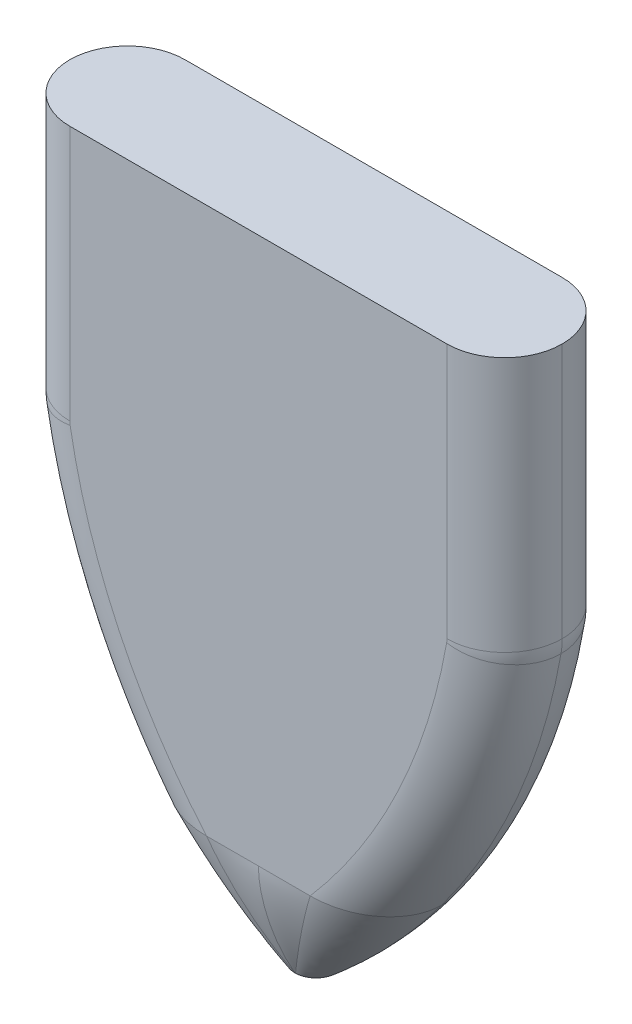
ISO-10303-21;
HEADER;
FILE_DESCRIPTION(('STEP AP214'),'2;1');
FILE_NAME('part.step','',(''),(''),'','','');
FILE_SCHEMA(('AUTOMOTIVE_DESIGN { 1 0 10303 214 1 1 1 1 }'));
ENDSEC;
DATA;
#1=APPLICATION_CONTEXT('core data for automotive mechanical design processes');
#2=APPLICATION_PROTOCOL_DEFINITION('international standard','automotive_design',2000,#1);
#3=PRODUCT_CONTEXT('',#1,'mechanical');
#4=PRODUCT('Part','Part','',(#3));
#5=PRODUCT_RELATED_PRODUCT_CATEGORY('part','',(#4));
#6=PRODUCT_DEFINITION_FORMATION('','',#4);
#7=PRODUCT_DEFINITION_CONTEXT('part definition',#1,'design');
#8=PRODUCT_DEFINITION('design','',#6,#7);
#9=PRODUCT_DEFINITION_SHAPE('','',#8);
#10=(LENGTH_UNIT() NAMED_UNIT(*) SI_UNIT(.MILLI.,.METRE.));
#11=(NAMED_UNIT(*) PLANE_ANGLE_UNIT() SI_UNIT($,.RADIAN.));
#12=(NAMED_UNIT(*) SI_UNIT($,.STERADIAN.) SOLID_ANGLE_UNIT());
#13=UNCERTAINTY_MEASURE_WITH_UNIT(LENGTH_MEASURE(1.E-05),#10,'distance_accuracy_value','');
#14=(GEOMETRIC_REPRESENTATION_CONTEXT(3) GLOBAL_UNCERTAINTY_ASSIGNED_CONTEXT((#13)) GLOBAL_UNIT_ASSIGNED_CONTEXT((#10,
#11,#12)) REPRESENTATION_CONTEXT('',''));
#15=CARTESIAN_POINT('',(0.,0.,0.));
#16=DIRECTION('',(0.,0.,1.));
#17=DIRECTION('',(1.,0.,0.));
#18=AXIS2_PLACEMENT_3D('',#15,#16,#17);
#19=CARTESIAN_POINT('',(-47.,125.5,11.));
#20=DIRECTION('',(0.,1.,0.));
#21=DIRECTION('',(0.,0.,1.));
#22=AXIS2_PLACEMENT_3D('',#19,#20,#21);
#23=PLANE('',#22);
#24=CARTESIAN_POINT('',(36.,125.5,0.));
#25=DIRECTION('',(0.,1.,0.));
#26=DIRECTION('',(0.,0.,1.));
#27=AXIS2_PLACEMENT_3D('',#24,#25,#26);
#28=CIRCLE('',#27,11.);
#29=CARTESIAN_POINT('',(36.,125.5,11.));
#30=VERTEX_POINT('',#29);
#31=CARTESIAN_POINT('',(47.,125.5,0.));
#32=VERTEX_POINT('',#31);
#33=EDGE_CURVE('E479',#30,#32,#28,.T.);
#34=ORIENTED_EDGE('',*,*,#33,.T.);
#35=CARTESIAN_POINT('',(36.,125.5,0.));
#36=DIRECTION('',(0.,1.,0.));
#37=DIRECTION('',(0.,0.,1.));
#38=AXIS2_PLACEMENT_3D('',#35,#36,#37);
#39=CIRCLE('',#38,11.);
#40=CARTESIAN_POINT('',(36.,125.5,-11.));
#41=VERTEX_POINT('',#40);
#42=EDGE_CURVE('E12',#32,#41,#39,.T.);
#43=ORIENTED_EDGE('',*,*,#42,.T.);
#44=DIRECTION('',(1.,0.,0.));
#45=VECTOR('',#44,1.);
#46=CARTESIAN_POINT('',(-47.,125.5,-11.));
#47=LINE('',#46,#45);
#48=CARTESIAN_POINT('',(-36.,125.5,-11.));
#49=VERTEX_POINT('',#48);
#50=EDGE_CURVE('E909',#49,#41,#47,.T.);
#51=ORIENTED_EDGE('',*,*,#50,.F.);
#52=CARTESIAN_POINT('',(-36.,125.5,0.));
#53=DIRECTION('',(0.,1.,0.));
#54=DIRECTION('',(0.,0.,1.));
#55=AXIS2_PLACEMENT_3D('',#52,#53,#54);
#56=CIRCLE('',#55,11.);
#57=CARTESIAN_POINT('',(-47.,125.5,0.));
#58=VERTEX_POINT('',#57);
#59=EDGE_CURVE('E939',#49,#58,#56,.T.);
#60=ORIENTED_EDGE('',*,*,#59,.T.);
#61=CARTESIAN_POINT('',(-36.,125.5,0.));
#62=DIRECTION('',(0.,1.,0.));
#63=DIRECTION('',(0.,0.,1.));
#64=AXIS2_PLACEMENT_3D('',#61,#62,#63);
#65=CIRCLE('',#64,11.);
#66=CARTESIAN_POINT('',(-36.,125.5,11.));
#67=VERTEX_POINT('',#66);
#68=EDGE_CURVE('E937',#58,#67,#65,.T.);
#69=ORIENTED_EDGE('',*,*,#68,.T.);
#70=DIRECTION('',(1.,0.,0.));
#71=VECTOR('',#70,1.);
#72=CARTESIAN_POINT('',(-47.,125.5,11.));
#73=LINE('',#72,#71);
#74=EDGE_CURVE('E912',#67,#30,#73,.T.);
#75=ORIENTED_EDGE('',*,*,#74,.T.);
#76=EDGE_LOOP('',(#34,#43,#51,#60,#69,#75));
#77=FACE_BOUND('',#76,.T.);
#78=ADVANCED_FACE('F471',(#77),#23,.T.);
#79=CARTESIAN_POINT('',(-76.3478497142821,95.7560601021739,11.));
#80=DIRECTION('',(0.,0.,-1.));
#81=DIRECTION('',(-1.,0.,0.));
#82=AXIS2_PLACEMENT_3D('',#79,#80,#81);
#83=PLANE('',#82);
#84=DIRECTION('',(-1.,0.,0.));
#85=VECTOR('',#84,1.);
#86=CARTESIAN_POINT('',(-76.3478497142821,21.2,11.));
#87=LINE('',#86,#85);
#88=CARTESIAN_POINT('',(-9.89247671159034,21.2,11.));
#89=VERTEX_POINT('',#88);
#90=CARTESIAN_POINT('',(0.,21.2,11.));
#91=VERTEX_POINT('',#90);
#92=EDGE_CURVE('E487',#89,#91,#87,.F.);
#93=ORIENTED_EDGE('',*,*,#92,.T.);
#94=DIRECTION('',(-1.,0.,0.));
#95=VECTOR('',#94,1.);
#96=CARTESIAN_POINT('',(-76.3478497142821,21.2,11.));
#97=LINE('',#96,#95);
#98=CARTESIAN_POINT('',(9.89247671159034,21.2,11.));
#99=VERTEX_POINT('',#98);
#100=EDGE_CURVE('E874',#91,#99,#97,.F.);
#101=ORIENTED_EDGE('',*,*,#100,.T.);
#102=CARTESIAN_POINT('',(-76.3478497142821,95.7560601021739,11.));
#103=DIRECTION('',(0.,0.,-1.));
#104=DIRECTION('',(-1.,0.,0.));
#105=AXIS2_PLACEMENT_3D('',#102,#103,#104);
#106=CIRCLE('',#105,114.);
#107=CARTESIAN_POINT('',(35.9399218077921,76.0721487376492,11.));
#108=VERTEX_POINT('',#107);
#109=EDGE_CURVE('E936',#99,#108,#106,.F.);
#110=ORIENTED_EDGE('',*,*,#109,.T.);
#111=CARTESIAN_POINT('',(32.,76.7628122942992,11.));
#112=DIRECTION('',(0.,0.,-1.));
#113=DIRECTION('',(-1.,0.,0.));
#114=AXIS2_PLACEMENT_3D('',#111,#112,#113);
#115=CIRCLE('',#114,3.99999999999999);
#116=CARTESIAN_POINT('',(36.,76.7628122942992,11.));
#117=VERTEX_POINT('',#116);
#118=EDGE_CURVE('E934',#108,#117,#115,.F.);
#119=ORIENTED_EDGE('',*,*,#118,.T.);
#120=DIRECTION('',(0.,-1.,0.));
#121=VECTOR('',#120,1.);
#122=CARTESIAN_POINT('',(36.,125.5,11.));
#123=LINE('',#122,#121);
#124=EDGE_CURVE('E932',#117,#30,#123,.F.);
#125=ORIENTED_EDGE('',*,*,#124,.T.);
#126=ORIENTED_EDGE('',*,*,#74,.F.);
#127=DIRECTION('',(0.,-1.,0.));
#128=VECTOR('',#127,1.);
#129=CARTESIAN_POINT('',(-36.,95.7560601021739,11.));
#130=LINE('',#129,#128);
#131=CARTESIAN_POINT('',(-36.,76.7628122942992,11.));
#132=VERTEX_POINT('',#131);
#133=EDGE_CURVE('E927',#67,#132,#130,.T.);
#134=ORIENTED_EDGE('',*,*,#133,.T.);
#135=CARTESIAN_POINT('',(-32.,76.7628122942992,11.));
#136=DIRECTION('',(0.,0.,-1.));
#137=DIRECTION('',(-1.,0.,0.));
#138=AXIS2_PLACEMENT_3D('',#135,#136,#137);
#139=CIRCLE('',#138,3.99999999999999);
#140=CARTESIAN_POINT('',(-35.9399218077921,76.0721487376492,11.));
#141=VERTEX_POINT('',#140);
#142=EDGE_CURVE('E929',#132,#141,#139,.F.);
#143=ORIENTED_EDGE('',*,*,#142,.T.);
#144=CARTESIAN_POINT('',(76.3478497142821,95.7560601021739,11.));
#145=DIRECTION('',(0.,0.,-1.));
#146=DIRECTION('',(-1.,0.,0.));
#147=AXIS2_PLACEMENT_3D('',#144,#145,#146);
#148=CIRCLE('',#147,114.);
#149=EDGE_CURVE('E931',#141,#89,#148,.F.);
#150=ORIENTED_EDGE('',*,*,#149,.T.);
#151=EDGE_LOOP('',(#93,#101,#110,#119,#125,#126,#134,#143,#150));
#152=FACE_BOUND('',#151,.T.);
#153=ADVANCED_FACE('F1029',(#152),#83,.F.);
#154=CARTESIAN_POINT('',(-76.3478497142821,95.7560601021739,-11.));
#155=DIRECTION('',(0.,0.,-1.));
#156=DIRECTION('',(-1.,0.,0.));
#157=AXIS2_PLACEMENT_3D('',#154,#155,#156);
#158=PLANE('',#157);
#159=DIRECTION('',(-1.,0.,0.));
#160=VECTOR('',#159,1.);
#161=CARTESIAN_POINT('',(-76.3478497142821,21.2,-11.));
#162=LINE('',#161,#160);
#163=CARTESIAN_POINT('',(-9.89247671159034,21.2,-11.));
#164=VERTEX_POINT('',#163);
#165=CARTESIAN_POINT('',(0.,21.2,-11.));
#166=VERTEX_POINT('',#165);
#167=EDGE_CURVE('E908',#164,#166,#162,.F.);
#168=ORIENTED_EDGE('',*,*,#167,.F.);
#169=CARTESIAN_POINT('',(76.3478497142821,95.7560601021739,-11.));
#170=DIRECTION('',(0.,0.,-1.));
#171=DIRECTION('',(-1.,0.,0.));
#172=AXIS2_PLACEMENT_3D('',#169,#170,#171);
#173=CIRCLE('',#172,114.);
#174=CARTESIAN_POINT('',(-35.9399218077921,76.0721487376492,-11.));
#175=VERTEX_POINT('',#174);
#176=EDGE_CURVE('E926',#164,#175,#173,.T.);
#177=ORIENTED_EDGE('',*,*,#176,.T.);
#178=CARTESIAN_POINT('',(-32.,76.7628122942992,-11.));
#179=DIRECTION('',(0.,0.,-1.));
#180=DIRECTION('',(-1.,0.,0.));
#181=AXIS2_PLACEMENT_3D('',#178,#179,#180);
#182=CIRCLE('',#181,3.99999999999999);
#183=CARTESIAN_POINT('',(-36.,76.7628122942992,-11.));
#184=VERTEX_POINT('',#183);
#185=EDGE_CURVE('E924',#175,#184,#182,.T.);
#186=ORIENTED_EDGE('',*,*,#185,.T.);
#187=DIRECTION('',(0.,-1.,0.));
#188=VECTOR('',#187,1.);
#189=CARTESIAN_POINT('',(-36.,125.5,-11.));
#190=LINE('',#189,#188);
#191=EDGE_CURVE('E922',#184,#49,#190,.F.);
#192=ORIENTED_EDGE('',*,*,#191,.T.);
#193=ORIENTED_EDGE('',*,*,#50,.T.);
#194=DIRECTION('',(0.,-1.,0.));
#195=VECTOR('',#194,1.);
#196=CARTESIAN_POINT('',(36.,95.7560601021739,-11.));
#197=LINE('',#196,#195);
#198=CARTESIAN_POINT('',(36.,76.7628122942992,-11.));
#199=VERTEX_POINT('',#198);
#200=EDGE_CURVE('E916',#41,#199,#197,.T.);
#201=ORIENTED_EDGE('',*,*,#200,.T.);
#202=CARTESIAN_POINT('',(32.,76.7628122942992,-11.));
#203=DIRECTION('',(0.,0.,-1.));
#204=DIRECTION('',(-1.,0.,0.));
#205=AXIS2_PLACEMENT_3D('',#202,#203,#204);
#206=CIRCLE('',#205,3.99999999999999);
#207=CARTESIAN_POINT('',(35.9399218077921,76.0721487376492,-11.));
#208=VERTEX_POINT('',#207);
#209=EDGE_CURVE('E918',#199,#208,#206,.T.);
#210=ORIENTED_EDGE('',*,*,#209,.T.);
#211=CARTESIAN_POINT('',(-76.3478497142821,95.7560601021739,-11.));
#212=DIRECTION('',(0.,0.,-1.));
#213=DIRECTION('',(-1.,0.,0.));
#214=AXIS2_PLACEMENT_3D('',#211,#212,#213);
#215=CIRCLE('',#214,114.);
#216=CARTESIAN_POINT('',(9.89247671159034,21.2,-11.));
#217=VERTEX_POINT('',#216);
#218=EDGE_CURVE('E921',#208,#217,#215,.T.);
#219=ORIENTED_EDGE('',*,*,#218,.T.);
#220=DIRECTION('',(-1.,0.,0.));
#221=VECTOR('',#220,1.);
#222=CARTESIAN_POINT('',(-76.3478497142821,21.2,-11.));
#223=LINE('',#222,#221);
#224=EDGE_CURVE('E495',#166,#217,#223,.F.);
#225=ORIENTED_EDGE('',*,*,#224,.F.);
#226=EDGE_LOOP('',(#168,#177,#186,#192,#193,#201,#210,#219,#225));
#227=FACE_BOUND('',#226,.T.);
#228=ADVANCED_FACE('F1026',(#227),#158,.T.);
#229=CARTESIAN_POINT('',(-36.,95.7560601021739,0.));
#230=DIRECTION('',(0.,-1.,0.));
#231=DIRECTION('',(1.,0.,0.));
#232=AXIS2_PLACEMENT_3D('',#229,#230,#231);
#233=CYLINDRICAL_SURFACE('',#232,11.);
#234=ORIENTED_EDGE('',*,*,#133,.F.);
#235=ORIENTED_EDGE('',*,*,#68,.F.);
#236=DIRECTION('',(0.,-1.,0.));
#237=VECTOR('',#236,1.);
#238=CARTESIAN_POINT('',(-47.,125.5,0.));
#239=LINE('',#238,#237);
#240=CARTESIAN_POINT('',(-47.,76.7628122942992,0.));
#241=VERTEX_POINT('',#240);
#242=EDGE_CURVE('E905',#241,#58,#239,.F.);
#243=ORIENTED_EDGE('',*,*,#242,.F.);
#244=CARTESIAN_POINT('',(-36.,76.7628122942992,0.));
#245=DIRECTION('',(0.,-1.,0.));
#246=DIRECTION('',(0.,0.,-1.));
#247=AXIS2_PLACEMENT_3D('',#244,#245,#246);
#248=CIRCLE('',#247,11.);
#249=EDGE_CURVE('E902',#132,#241,#248,.T.);
#250=ORIENTED_EDGE('',*,*,#249,.F.);
#251=EDGE_LOOP('',(#234,#235,#243,#250));
#252=FACE_BOUND('',#251,.T.);
#253=ADVANCED_FACE('F1022',(#252),#233,.T.);
#254=CARTESIAN_POINT('',(-36.,125.5,0.));
#255=DIRECTION('',(0.,1.,0.));
#256=DIRECTION('',(-1.,0.,0.));
#257=AXIS2_PLACEMENT_3D('',#254,#255,#256);
#258=CYLINDRICAL_SURFACE('',#257,11.);
#259=ORIENTED_EDGE('',*,*,#59,.F.);
#260=ORIENTED_EDGE('',*,*,#191,.F.);
#261=CARTESIAN_POINT('',(-36.,76.7628122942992,0.));
#262=DIRECTION('',(0.,-1.,0.));
#263=DIRECTION('',(0.,0.,-1.));
#264=AXIS2_PLACEMENT_3D('',#261,#262,#263);
#265=CIRCLE('',#264,11.);
#266=EDGE_CURVE('E899',#241,#184,#265,.T.);
#267=ORIENTED_EDGE('',*,*,#266,.F.);
#268=ORIENTED_EDGE('',*,*,#242,.T.);
#269=EDGE_LOOP('',(#259,#260,#267,#268));
#270=FACE_BOUND('',#269,.T.);
#271=ADVANCED_FACE('F1018',(#270),#258,.T.);
#272=CARTESIAN_POINT('',(-32.,76.7628122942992,0.));
#273=DIRECTION('',(0.,0.,-1.));
#274=DIRECTION('',(-1.,0.,0.));
#275=AXIS2_PLACEMENT_3D('',#272,#273,#274);
#276=DEGENERATE_TOROIDAL_SURFACE('',#275,3.99999999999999,11.,.T.);
#277=ORIENTED_EDGE('',*,*,#142,.F.);
#278=ORIENTED_EDGE('',*,*,#249,.T.);
#279=CARTESIAN_POINT('',(-32.,76.7628122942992,0.));
#280=DIRECTION('',(0.,0.,-1.));
#281=DIRECTION('',(-1.,0.,0.));
#282=AXIS2_PLACEMENT_3D('',#279,#280,#281);
#283=CIRCLE('',#282,15.);
#284=CARTESIAN_POINT('',(-46.7747067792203,74.1728239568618,0.));
#285=VERTEX_POINT('',#284);
#286=EDGE_CURVE('E896',#285,#241,#283,.T.);
#287=ORIENTED_EDGE('',*,*,#286,.F.);
#288=CARTESIAN_POINT('',(-35.9399218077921,76.0721487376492,0.));
#289=DIRECTION('',(0.172665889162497,-0.984980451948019,0.));
#290=DIRECTION('',(0.984980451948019,0.172665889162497,0.));
#291=AXIS2_PLACEMENT_3D('',#288,#289,#290);
#292=CIRCLE('',#291,11.);
#293=EDGE_CURVE('E893',#141,#285,#292,.T.);
#294=ORIENTED_EDGE('',*,*,#293,.F.);
#295=EDGE_LOOP('',(#277,#278,#287,#294));
#296=FACE_BOUND('',#295,.T.);
#297=ADVANCED_FACE('F1014',(#296),#276,.T.);
#298=CARTESIAN_POINT('',(-32.,76.7628122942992,0.));
#299=DIRECTION('',(0.,0.,-1.));
#300=DIRECTION('',(-1.,0.,0.));
#301=AXIS2_PLACEMENT_3D('',#298,#299,#300);
#302=DEGENERATE_TOROIDAL_SURFACE('',#301,3.99999999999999,11.,.T.);
#303=ORIENTED_EDGE('',*,*,#266,.T.);
#304=ORIENTED_EDGE('',*,*,#185,.F.);
#305=CARTESIAN_POINT('',(-35.9399218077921,76.0721487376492,0.));
#306=DIRECTION('',(0.172665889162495,-0.98498045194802,0.));
#307=DIRECTION('',(0.98498045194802,0.172665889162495,0.));
#308=AXIS2_PLACEMENT_3D('',#305,#306,#307);
#309=CIRCLE('',#308,11.);
#310=EDGE_CURVE('E891',#285,#175,#309,.T.);
#311=ORIENTED_EDGE('',*,*,#310,.F.);
#312=ORIENTED_EDGE('',*,*,#286,.T.);
#313=EDGE_LOOP('',(#303,#304,#311,#312));
#314=FACE_BOUND('',#313,.T.);
#315=ADVANCED_FACE('F1009',(#314),#302,.T.);
#316=CARTESIAN_POINT('',(76.3478497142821,95.7560601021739,0.));
#317=DIRECTION('',(0.,0.,-1.));
#318=DIRECTION('',(-1.,0.,0.));
#319=AXIS2_PLACEMENT_3D('',#316,#317,#318);
#320=TOROIDAL_SURFACE('',#319,114.,11.);
#321=ORIENTED_EDGE('',*,*,#149,.F.);
#322=ORIENTED_EDGE('',*,*,#293,.T.);
#323=CARTESIAN_POINT('',(76.3478497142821,95.7560601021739,0.));
#324=DIRECTION('',(0.,0.,-1.));
#325=DIRECTION('',(-1.,0.,0.));
#326=AXIS2_PLACEMENT_3D('',#323,#324,#325);
#327=CIRCLE('',#326,125.);
#328=CARTESIAN_POINT('',(-23.9835705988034,21.2,0.));
#329=VERTEX_POINT('',#328);
#330=EDGE_CURVE('E890',#329,#285,#327,.T.);
#331=ORIENTED_EDGE('',*,*,#330,.F.);
#332=CARTESIAN_POINT('',(-9.89247671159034,21.2,11.));
#333=CARTESIAN_POINT('',(-10.7230369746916,21.2,11.));
#334=CARTESIAN_POINT('',(-11.5454341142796,21.2,10.946537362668));
#335=CARTESIAN_POINT('',(-13.1735878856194,21.2,10.7306286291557));
#336=CARTESIAN_POINT('',(-13.9793576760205,21.2,10.5682687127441));
#337=CARTESIAN_POINT('',(-15.1741864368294,21.2,10.2341788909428));
#338=CARTESIAN_POINT('',(-15.571418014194,21.2,10.1070809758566));
#339=CARTESIAN_POINT('',(-16.3490375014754,21.2,9.82441507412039));
#340=CARTESIAN_POINT('',(-16.7305553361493,21.2,9.66863843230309));
#341=CARTESIAN_POINT('',(-17.8523868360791,21.2,9.15630114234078));
#342=CARTESIAN_POINT('',(-18.5702612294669,21.2,8.7552931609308));
#343=CARTESIAN_POINT('',(-19.5945920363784,21.2,8.04982813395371));
#344=CARTESIAN_POINT('',(-19.9272756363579,21.2,7.79681183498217));
#345=CARTESIAN_POINT('',(-20.5593468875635,21.2,7.26404191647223));
#346=CARTESIAN_POINT('',(-20.8605775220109,21.2,6.98312245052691));
#347=CARTESIAN_POINT('',(-21.4317139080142,21.2,6.39053093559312));
#348=CARTESIAN_POINT('',(-21.7016335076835,21.2,6.07887248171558));
#349=CARTESIAN_POINT('',(-22.2072382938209,21.2,5.42194661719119));
#350=CARTESIAN_POINT('',(-22.4434127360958,21.2,5.07517524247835));
#351=CARTESIAN_POINT('',(-23.0764925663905,21.2,4.01070997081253));
#352=CARTESIAN_POINT('',(-23.4063989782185,21.2,3.26085550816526));
#353=CARTESIAN_POINT('',(-23.7483785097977,21.2,2.06936012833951));
#354=CARTESIAN_POINT('',(-23.8367678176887,21.2,1.65832833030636));
#355=CARTESIAN_POINT('',(-23.9539325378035,21.2,0.833714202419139));
#356=CARTESIAN_POINT('',(-23.9835705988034,21.2,0.418397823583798));
#357=CARTESIAN_POINT('',(-23.9835705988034,21.2,0.));
#358=B_SPLINE_CURVE_WITH_KNOTS('',3,(#332,#333,#334,#335,#336,#337,#338,#339,#340,#341,#342,
#343,#344,#345,#346,#347,#348,#349,#350,#351,#352,#353,#354,#355,#356,#357),.UNSPECIFIED.,.F.,
.F.,(4,2,2,2,2,2,2,2,2,2,2,2,4),(0.5,0.5625,0.625,0.65625,0.6875,0.75,0.78125,0.8125,0.84375,
0.875,0.9375,0.96875,1.),.UNSPECIFIED.);
#359=EDGE_CURVE('E915',#89,#329,#358,.T.);
#360=ORIENTED_EDGE('',*,*,#359,.F.);
#361=EDGE_LOOP('',(#321,#322,#331,#360));
#362=FACE_BOUND('',#361,.T.);
#363=ADVANCED_FACE('F998',(#362),#320,.T.);
#364=CARTESIAN_POINT('',(76.3478497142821,95.7560601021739,0.));
#365=DIRECTION('',(0.,0.,-1.));
#366=DIRECTION('',(-1.,0.,0.));
#367=AXIS2_PLACEMENT_3D('',#364,#365,#366);
#368=TOROIDAL_SURFACE('',#367,114.,11.);
#369=ORIENTED_EDGE('',*,*,#310,.T.);
#370=ORIENTED_EDGE('',*,*,#176,.F.);
#371=CARTESIAN_POINT('',(-23.9835705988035,21.2,0.));
#372=CARTESIAN_POINT('',(-23.9835705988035,21.2,-0.835508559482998));
#373=CARTESIAN_POINT('',(-23.8666028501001,21.2,-1.65000868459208));
#374=CARTESIAN_POINT('',(-23.5275362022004,21.2,-2.84237217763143));
#375=CARTESIAN_POINT('',(-23.3856176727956,21.2,-3.23734246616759));
#376=CARTESIAN_POINT('',(-23.055122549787,21.2,-3.99709795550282));
#377=CARTESIAN_POINT('',(-22.866401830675,21.2,-4.36374467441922));
#378=CARTESIAN_POINT('',(-22.4452046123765,21.2,-5.0723744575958));
#379=CARTESIAN_POINT('',(-22.2127128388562,21.2,-5.41434891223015));
#380=CARTESIAN_POINT('',(-21.7054088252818,21.2,-6.07444320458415));
#381=CARTESIAN_POINT('',(-21.4332798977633,21.2,-6.38886438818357));
#382=CARTESIAN_POINT('',(-20.8601335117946,21.2,-6.98362478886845));
#383=CARTESIAN_POINT('',(-20.5583482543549,21.2,-7.26493861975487));
#384=CARTESIAN_POINT('',(-19.92634730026,21.2,-7.79753919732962));
#385=CARTESIAN_POINT('',(-19.5947332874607,21.2,-8.04974875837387));
#386=CARTESIAN_POINT('',(-18.568814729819,21.2,-8.75625353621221));
#387=CARTESIAN_POINT('',(-17.8509677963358,21.2,-9.15696122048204));
#388=CARTESIAN_POINT('',(-16.7309913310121,21.2,-9.66843330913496));
#389=CARTESIAN_POINT('',(-16.3503940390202,21.2,-9.82384564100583));
#390=CARTESIAN_POINT('',(-15.5752575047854,21.2,-10.1057611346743));
#391=CARTESIAN_POINT('',(-15.1792907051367,21.2,-10.2326386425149));
#392=CARTESIAN_POINT('',(-13.9818180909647,21.2,-10.5678050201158));
#393=CARTESIAN_POINT('',(-13.1748244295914,21.2,-10.7304402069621));
#394=CARTESIAN_POINT('',(-11.5452627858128,21.2,-10.9465845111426));
#395=CARTESIAN_POINT('',(-10.7226814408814,21.2,-11.));
#396=CARTESIAN_POINT('',(-9.89247671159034,21.2,-11.));
#397=B_SPLINE_CURVE_WITH_KNOTS('',3,(#371,#372,#373,#374,#375,#376,#377,#378,#379,#380,#381,
#382,#383,#384,#385,#386,#387,#388,#389,#390,#391,#392,#393,#394,#395,#396),.UNSPECIFIED.,.F.,
.F.,(4,2,2,2,2,2,2,2,2,2,2,2,4),(0.,0.0625000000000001,0.0937500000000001,0.125,0.15625,0.1875,
0.21875,0.25,0.3125,0.34375,0.375,0.4375,0.5),.UNSPECIFIED.);
#398=EDGE_CURVE('E812',#329,#164,#397,.T.);
#399=ORIENTED_EDGE('',*,*,#398,.F.);
#400=ORIENTED_EDGE('',*,*,#330,.T.);
#401=EDGE_LOOP('',(#369,#370,#399,#400));
#402=FACE_BOUND('',#401,.T.);
#403=ADVANCED_FACE('F1008',(#402),#368,.T.);
#404=CARTESIAN_POINT('',(36.,125.5,0.));
#405=DIRECTION('',(0.,1.,0.));
#406=DIRECTION('',(0.,0.,1.));
#407=AXIS2_PLACEMENT_3D('',#404,#405,#406);
#408=CYLINDRICAL_SURFACE('',#407,11.);
#409=ORIENTED_EDGE('',*,*,#33,.F.);
#410=ORIENTED_EDGE('',*,*,#124,.F.);
#411=CARTESIAN_POINT('',(36.,76.7628122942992,0.));
#412=DIRECTION('',(0.,-1.,0.));
#413=DIRECTION('',(0.,0.,-1.));
#414=AXIS2_PLACEMENT_3D('',#411,#412,#413);
#415=CIRCLE('',#414,11.);
#416=CARTESIAN_POINT('',(47.,76.7628122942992,0.));
#417=VERTEX_POINT('',#416);
#418=EDGE_CURVE('E887',#417,#117,#415,.T.);
#419=ORIENTED_EDGE('',*,*,#418,.F.);
#420=DIRECTION('',(0.,-1.,0.));
#421=VECTOR('',#420,1.);
#422=CARTESIAN_POINT('',(47.,76.7628122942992,0.));
#423=LINE('',#422,#421);
#424=EDGE_CURVE('E884',#32,#417,#423,.T.);
#425=ORIENTED_EDGE('',*,*,#424,.F.);
#426=EDGE_LOOP('',(#409,#410,#419,#425));
#427=FACE_BOUND('',#426,.T.);
#428=ADVANCED_FACE('F1044',(#427),#408,.T.);
#429=CARTESIAN_POINT('',(32.,76.7628122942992,0.));
#430=DIRECTION('',(0.,0.,-1.));
#431=DIRECTION('',(-1.,0.,0.));
#432=AXIS2_PLACEMENT_3D('',#429,#430,#431);
#433=DEGENERATE_TOROIDAL_SURFACE('',#432,3.99999999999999,11.,.T.);
#434=ORIENTED_EDGE('',*,*,#418,.T.);
#435=ORIENTED_EDGE('',*,*,#118,.F.);
#436=CARTESIAN_POINT('',(35.9399218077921,76.0721487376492,0.));
#437=DIRECTION('',(-0.172665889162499,-0.984980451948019,0.));
#438=DIRECTION('',(0.984980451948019,-0.172665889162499,0.));
#439=AXIS2_PLACEMENT_3D('',#436,#437,#438);
#440=CIRCLE('',#439,11.);
#441=CARTESIAN_POINT('',(46.7747067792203,74.1728239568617,0.));
#442=VERTEX_POINT('',#441);
#443=EDGE_CURVE('E881',#442,#108,#440,.T.);
#444=ORIENTED_EDGE('',*,*,#443,.F.);
#445=CARTESIAN_POINT('',(32.,76.7628122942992,0.));
#446=DIRECTION('',(0.,0.,-1.));
#447=DIRECTION('',(-1.,0.,0.));
#448=AXIS2_PLACEMENT_3D('',#445,#446,#447);
#449=CIRCLE('',#448,15.);
#450=EDGE_CURVE('E878',#417,#442,#449,.T.);
#451=ORIENTED_EDGE('',*,*,#450,.F.);
#452=EDGE_LOOP('',(#434,#435,#444,#451));
#453=FACE_BOUND('',#452,.T.);
#454=ADVANCED_FACE('F1061',(#453),#433,.T.);
#455=CARTESIAN_POINT('',(36.,95.7560601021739,0.));
#456=DIRECTION('',(0.,-1.,0.));
#457=DIRECTION('',(0.,0.,-1.));
#458=AXIS2_PLACEMENT_3D('',#455,#456,#457);
#459=CYLINDRICAL_SURFACE('',#458,11.);
#460=ORIENTED_EDGE('',*,*,#42,.F.);
#461=ORIENTED_EDGE('',*,*,#424,.T.);
#462=CARTESIAN_POINT('',(36.,76.7628122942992,0.));
#463=DIRECTION('',(0.,-1.,0.));
#464=DIRECTION('',(0.,0.,-1.));
#465=AXIS2_PLACEMENT_3D('',#462,#463,#464);
#466=CIRCLE('',#465,11.);
#467=EDGE_CURVE('E875',#199,#417,#466,.T.);
#468=ORIENTED_EDGE('',*,*,#467,.F.);
#469=ORIENTED_EDGE('',*,*,#200,.F.);
#470=EDGE_LOOP('',(#460,#461,#468,#469));
#471=FACE_BOUND('',#470,.T.);
#472=ADVANCED_FACE('F971',(#471),#459,.T.);
#473=CARTESIAN_POINT('',(-76.3478497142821,95.7560601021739,0.));
#474=DIRECTION('',(0.,0.,-1.));
#475=DIRECTION('',(-1.,0.,0.));
#476=AXIS2_PLACEMENT_3D('',#473,#474,#475);
#477=TOROIDAL_SURFACE('',#476,114.,11.);
#478=ORIENTED_EDGE('',*,*,#109,.F.);
#479=CARTESIAN_POINT('',(23.9835705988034,21.2,0.));
#480=CARTESIAN_POINT('',(23.9835705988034,21.2,0.418397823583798));
#481=CARTESIAN_POINT('',(23.9539325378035,21.2,0.833714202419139));
#482=CARTESIAN_POINT('',(23.8367678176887,21.2,1.65832833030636));
#483=CARTESIAN_POINT('',(23.7483785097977,21.2,2.06936012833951));
#484=CARTESIAN_POINT('',(23.4063989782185,21.2,3.26085550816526));
#485=CARTESIAN_POINT('',(23.0764925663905,21.2,4.01070997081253));
#486=CARTESIAN_POINT('',(22.4434127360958,21.2,5.07517524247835));
#487=CARTESIAN_POINT('',(22.2072382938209,21.2,5.42194661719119));
#488=CARTESIAN_POINT('',(21.7016335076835,21.2,6.07887248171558));
#489=CARTESIAN_POINT('',(21.4317139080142,21.2,6.39053093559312));
#490=CARTESIAN_POINT('',(20.8605775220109,21.2,6.98312245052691));
#491=CARTESIAN_POINT('',(20.5593468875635,21.2,7.26404191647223));
#492=CARTESIAN_POINT('',(19.9272756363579,21.2,7.79681183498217));
#493=CARTESIAN_POINT('',(19.5945920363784,21.2,8.04982813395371));
#494=CARTESIAN_POINT('',(18.5702612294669,21.2,8.7552931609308));
#495=CARTESIAN_POINT('',(17.8523868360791,21.2,9.15630114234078));
#496=CARTESIAN_POINT('',(16.7305553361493,21.2,9.66863843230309));
#497=CARTESIAN_POINT('',(16.3490375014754,21.2,9.82441507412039));
#498=CARTESIAN_POINT('',(15.571418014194,21.2,10.1070809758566));
#499=CARTESIAN_POINT('',(15.1741864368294,21.2,10.2341788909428));
#500=CARTESIAN_POINT('',(13.9793576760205,21.2,10.5682687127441));
#501=CARTESIAN_POINT('',(13.1735878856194,21.2,10.7306286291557));
#502=CARTESIAN_POINT('',(11.5454341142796,21.2,10.946537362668));
#503=CARTESIAN_POINT('',(10.7230369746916,21.2,11.));
#504=CARTESIAN_POINT('',(9.89247671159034,21.2,11.));
#505=B_SPLINE_CURVE_WITH_KNOTS('',3,(#479,#480,#481,#482,#483,#484,#485,#486,#487,#488,#489,
#490,#491,#492,#493,#494,#495,#496,#497,#498,#499,#500,#501,#502,#503,#504),.UNSPECIFIED.,.F.,
.F.,(4,2,2,2,2,2,2,2,2,2,2,2,4),(0.,0.0312499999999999,0.0625,0.125,0.15625,0.1875,0.21875,0.25,
0.3125,0.34375,0.375,0.4375,0.5),.UNSPECIFIED.);
#506=CARTESIAN_POINT('',(23.9835705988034,21.2,0.));
#507=VERTEX_POINT('',#506);
#508=EDGE_CURVE('E769',#507,#99,#505,.T.);
#509=ORIENTED_EDGE('',*,*,#508,.F.);
#510=CARTESIAN_POINT('',(-76.3478497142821,95.7560601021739,0.));
#511=DIRECTION('',(0.,0.,-1.));
#512=DIRECTION('',(-1.,0.,0.));
#513=AXIS2_PLACEMENT_3D('',#510,#511,#512);
#514=CIRCLE('',#513,125.);
#515=EDGE_CURVE('E873',#442,#507,#514,.T.);
#516=ORIENTED_EDGE('',*,*,#515,.F.);
#517=ORIENTED_EDGE('',*,*,#443,.T.);
#518=EDGE_LOOP('',(#478,#509,#516,#517));
#519=FACE_BOUND('',#518,.T.);
#520=ADVANCED_FACE('F966',(#519),#477,.T.);
#521=CARTESIAN_POINT('',(32.,76.7628122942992,0.));
#522=DIRECTION('',(0.,0.,-1.));
#523=DIRECTION('',(-1.,0.,0.));
#524=AXIS2_PLACEMENT_3D('',#521,#522,#523);
#525=DEGENERATE_TOROIDAL_SURFACE('',#524,3.99999999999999,11.,.T.);
#526=ORIENTED_EDGE('',*,*,#467,.T.);
#527=ORIENTED_EDGE('',*,*,#450,.T.);
#528=CARTESIAN_POINT('',(35.9399218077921,76.0721487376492,0.));
#529=DIRECTION('',(-0.172665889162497,-0.984980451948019,0.));
#530=DIRECTION('',(0.984980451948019,-0.172665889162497,0.));
#531=AXIS2_PLACEMENT_3D('',#528,#529,#530);
#532=CIRCLE('',#531,11.);
#533=EDGE_CURVE('E865',#208,#442,#532,.T.);
#534=ORIENTED_EDGE('',*,*,#533,.F.);
#535=ORIENTED_EDGE('',*,*,#209,.F.);
#536=EDGE_LOOP('',(#526,#527,#534,#535));
#537=FACE_BOUND('',#536,.T.);
#538=ADVANCED_FACE('F960',(#537),#525,.T.);
#539=CARTESIAN_POINT('',(-76.3478497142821,95.7560601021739,0.));
#540=DIRECTION('',(0.,0.,-1.));
#541=DIRECTION('',(-1.,0.,0.));
#542=AXIS2_PLACEMENT_3D('',#539,#540,#541);
#543=TOROIDAL_SURFACE('',#542,114.,11.);
#544=ORIENTED_EDGE('',*,*,#533,.T.);
#545=ORIENTED_EDGE('',*,*,#515,.T.);
#546=CARTESIAN_POINT('',(9.89247671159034,21.2,-11.));
#547=CARTESIAN_POINT('',(10.7226814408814,21.2,-11.));
#548=CARTESIAN_POINT('',(11.5452627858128,21.2,-10.9465845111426));
#549=CARTESIAN_POINT('',(13.1748244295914,21.2,-10.7304402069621));
#550=CARTESIAN_POINT('',(13.9818180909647,21.2,-10.5678050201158));
#551=CARTESIAN_POINT('',(15.1792907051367,21.2,-10.2326386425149));
#552=CARTESIAN_POINT('',(15.5752575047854,21.2,-10.1057611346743));
#553=CARTESIAN_POINT('',(16.3503940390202,21.2,-9.82384564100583));
#554=CARTESIAN_POINT('',(16.7309913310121,21.2,-9.66843330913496));
#555=CARTESIAN_POINT('',(17.8509677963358,21.2,-9.15696122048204));
#556=CARTESIAN_POINT('',(18.568814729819,21.2,-8.75625353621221));
#557=CARTESIAN_POINT('',(19.5947332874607,21.2,-8.04974875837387));
#558=CARTESIAN_POINT('',(19.92634730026,21.2,-7.79753919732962));
#559=CARTESIAN_POINT('',(20.5583482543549,21.2,-7.26493861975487));
#560=CARTESIAN_POINT('',(20.8601335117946,21.2,-6.98362478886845));
#561=CARTESIAN_POINT('',(21.4332798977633,21.2,-6.38886438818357));
#562=CARTESIAN_POINT('',(21.7054088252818,21.2,-6.07444320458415));
#563=CARTESIAN_POINT('',(22.2127128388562,21.2,-5.41434891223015));
#564=CARTESIAN_POINT('',(22.4452046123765,21.2,-5.0723744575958));
#565=CARTESIAN_POINT('',(22.866401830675,21.2,-4.36374467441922));
#566=CARTESIAN_POINT('',(23.055122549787,21.2,-3.99709795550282));
#567=CARTESIAN_POINT('',(23.3856176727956,21.2,-3.23734246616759));
#568=CARTESIAN_POINT('',(23.5275362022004,21.2,-2.84237217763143));
#569=CARTESIAN_POINT('',(23.8666028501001,21.2,-1.65000868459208));
#570=CARTESIAN_POINT('',(23.9835705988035,21.2,-0.835508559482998));
#571=CARTESIAN_POINT('',(23.9835705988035,21.2,0.));
#572=B_SPLINE_CURVE_WITH_KNOTS('',3,(#546,#547,#548,#549,#550,#551,#552,#553,#554,#555,#556,
#557,#558,#559,#560,#561,#562,#563,#564,#565,#566,#567,#568,#569,#570,#571),.UNSPECIFIED.,.F.,
.F.,(4,2,2,2,2,2,2,2,2,2,2,2,4),(0.5,0.5625,0.625,0.65625,0.6875,0.75,0.78125,0.8125,0.84375,
0.875,0.90625,0.9375,1.),.UNSPECIFIED.);
#573=EDGE_CURVE('E919',#217,#507,#572,.T.);
#574=ORIENTED_EDGE('',*,*,#573,.F.);
#575=ORIENTED_EDGE('',*,*,#218,.F.);
#576=EDGE_LOOP('',(#544,#545,#574,#575));
#577=FACE_BOUND('',#576,.T.);
#578=ADVANCED_FACE('F833',(#577),#543,.T.);
#579=CARTESIAN_POINT('',(0.,0.,0.));
#580=DIRECTION('',(0.,-1.,0.));
#581=DIRECTION('',(0.,0.,-1.));
#582=AXIS2_PLACEMENT_3D('',#579,#580,#581);
#583=PLANE('',#582);
#584=CARTESIAN_POINT('',(0.0999375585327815,0.,3.99875136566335));
#585=CARTESIAN_POINT('',(0.370959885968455,0.,3.99197792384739));
#586=CARTESIAN_POINT('',(0.635165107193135,0.,3.95830572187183));
#587=CARTESIAN_POINT('',(1.14488044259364,0.,3.84235275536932));
#588=CARTESIAN_POINT('',(1.39039055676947,0.,3.76007199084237));
#589=CARTESIAN_POINT('',(1.74083872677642,0.,3.60408614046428));
#590=CARTESIAN_POINT('',(1.85468528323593,0.,3.54666340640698));
#591=CARTESIAN_POINT('',(2.07580678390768,0.,3.42161165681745));
#592=CARTESIAN_POINT('',(2.1830817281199,0.,3.35398264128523));
#593=CARTESIAN_POINT('',(2.49410022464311,0.,3.13675910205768));
#594=CARTESIAN_POINT('',(2.68703744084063,0.,2.97282808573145));
#595=CARTESIAN_POINT('',(2.9510349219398,0.,2.70215029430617));
#596=CARTESIAN_POINT('',(3.03479935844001,0.,2.60779415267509));
#597=CARTESIAN_POINT('',(3.1932261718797,0.,2.41147006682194));
#598=CARTESIAN_POINT('',(3.26788854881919,0.,2.30950212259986));
#599=CARTESIAN_POINT('',(3.40747863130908,0.,2.0986030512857));
#600=CARTESIAN_POINT('',(3.47240633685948,0.,1.9896719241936));
#601=CARTESIAN_POINT('',(3.59189446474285,0.,1.76549510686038));
#602=CARTESIAN_POINT('',(3.64645488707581,0.,1.65024941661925));
#603=CARTESIAN_POINT('',(3.79363631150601,0.,1.29601343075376));
#604=CARTESIAN_POINT('',(3.86975747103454,0.,1.04852421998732));
#605=CARTESIAN_POINT('',(3.94714385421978,0.,0.664184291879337));
#606=CARTESIAN_POINT('',(3.96680675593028,0.,0.533886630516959));
#607=CARTESIAN_POINT('',(3.99323482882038,0.,0.269571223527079));
#608=CARTESIAN_POINT('',(4.,0.,0.135553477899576));
#609=CARTESIAN_POINT('',(4.,0.,0.));
#610=B_SPLINE_CURVE_WITH_KNOTS('',3,(#584,#585,#586,#587,#588,#589,#590,#591,#592,#593,#594,
#595,#596,#597,#598,#599,#600,#601,#602,#603,#604,#605,#606,#607,#608,#609),.UNSPECIFIED.,.F.,
.F.,(4,2,2,2,2,2,2,2,2,2,2,2,4),(0.,0.0625000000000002,0.125,0.15625,0.1875,0.25,0.28125,0.3125,
0.34375,0.375,0.4375,0.46875,0.5),.UNSPECIFIED.);
#611=CARTESIAN_POINT('',(0.0999375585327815,0.,3.99875136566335));
#612=VERTEX_POINT('',#611);
#613=CARTESIAN_POINT('',(4.,0.,0.));
#614=VERTEX_POINT('',#613);
#615=EDGE_CURVE('E621',#612,#614,#610,.T.);
#616=ORIENTED_EDGE('',*,*,#615,.F.);
#617=CARTESIAN_POINT('',(-0.00132658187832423,0.,3.99875136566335));
#618=CARTESIAN_POINT('',(0.0324281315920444,0.,3.99875136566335));
#619=CARTESIAN_POINT('',(0.066182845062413,0.,3.99875136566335));
#620=CARTESIAN_POINT('',(0.0999375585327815,0.,3.99875136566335));
#621=B_SPLINE_CURVE_WITH_KNOTS('',3,(#617,#618,#619,#620),.UNSPECIFIED.,.F.,.F.,(4,4),(0.5,1.),.UNSPECIFIED.);
#622=CARTESIAN_POINT('',(-0.00132658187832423,0.,3.99875136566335));
#623=VERTEX_POINT('',#622);
#624=EDGE_CURVE('E787',#623,#612,#621,.T.);
#625=ORIENTED_EDGE('',*,*,#624,.F.);
#626=CARTESIAN_POINT('',(-0.099937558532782,0.,3.99875136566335));
#627=CARTESIAN_POINT('',(-0.0670672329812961,0.,3.99875136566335));
#628=CARTESIAN_POINT('',(-0.0341969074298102,0.,3.99875136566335));
#629=CARTESIAN_POINT('',(-0.00132658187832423,0.,3.99875136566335));
#630=B_SPLINE_CURVE_WITH_KNOTS('',3,(#626,#627,#628,#629),.UNSPECIFIED.,.F.,.F.,(4,4),(0.,0.5),.UNSPECIFIED.);
#631=CARTESIAN_POINT('',(-0.099937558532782,0.,3.99875136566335));
#632=VERTEX_POINT('',#631);
#633=EDGE_CURVE('E683',#632,#623,#630,.T.);
#634=ORIENTED_EDGE('',*,*,#633,.F.);
#635=CARTESIAN_POINT('',(-4.,0.,0.));
#636=CARTESIAN_POINT('',(-4.,0.,0.135553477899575));
#637=CARTESIAN_POINT('',(-3.99323482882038,0.,0.269571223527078));
#638=CARTESIAN_POINT('',(-3.96680675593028,0.,0.533886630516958));
#639=CARTESIAN_POINT('',(-3.94714385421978,0.,0.664184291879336));
#640=CARTESIAN_POINT('',(-3.86975747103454,0.,1.04852421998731));
#641=CARTESIAN_POINT('',(-3.79363631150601,0.,1.29601343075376));
#642=CARTESIAN_POINT('',(-3.64645488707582,0.,1.65024941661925));
#643=CARTESIAN_POINT('',(-3.59189446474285,0.,1.76549510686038));
#644=CARTESIAN_POINT('',(-3.47240633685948,0.,1.9896719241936));
#645=CARTESIAN_POINT('',(-3.40747863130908,0.,2.0986030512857));
#646=CARTESIAN_POINT('',(-3.26788854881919,0.,2.30950212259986));
#647=CARTESIAN_POINT('',(-3.1932261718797,0.,2.41147006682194));
#648=CARTESIAN_POINT('',(-3.03479935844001,0.,2.60779415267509));
#649=CARTESIAN_POINT('',(-2.9510349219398,0.,2.70215029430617));
#650=CARTESIAN_POINT('',(-2.68703744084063,0.,2.97282808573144));
#651=CARTESIAN_POINT('',(-2.49410022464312,0.,3.13675910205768));
#652=CARTESIAN_POINT('',(-2.1830817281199,0.,3.35398264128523));
#653=CARTESIAN_POINT('',(-2.07580678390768,0.,3.42161165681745));
#654=CARTESIAN_POINT('',(-1.85468528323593,0.,3.54666340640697));
#655=CARTESIAN_POINT('',(-1.74083872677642,0.,3.60408614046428));
#656=CARTESIAN_POINT('',(-1.39039055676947,0.,3.76007199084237));
#657=CARTESIAN_POINT('',(-1.14488044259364,0.,3.84235275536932));
#658=CARTESIAN_POINT('',(-0.635165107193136,0.,3.95830572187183));
#659=CARTESIAN_POINT('',(-0.370959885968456,0.,3.99197792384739));
#660=CARTESIAN_POINT('',(-0.099937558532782,0.,3.99875136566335));
#661=B_SPLINE_CURVE_WITH_KNOTS('',3,(#635,#636,#637,#638,#639,#640,#641,#642,#643,#644,#645,
#646,#647,#648,#649,#650,#651,#652,#653,#654,#655,#656,#657,#658,#659,#660),.UNSPECIFIED.,.F.,
.F.,(4,2,2,2,2,2,2,2,2,2,2,2,4),(0.5,0.53125,0.5625,0.625,0.65625,0.6875,0.71875,0.75,0.8125,
0.84375,0.875,0.9375,1.),.UNSPECIFIED.);
#662=CARTESIAN_POINT('',(-4.,0.,0.));
#663=VERTEX_POINT('',#662);
#664=EDGE_CURVE('E788',#663,#632,#661,.T.);
#665=ORIENTED_EDGE('',*,*,#664,.F.);
#666=CARTESIAN_POINT('',(-0.0999375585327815,0.,-3.99875136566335));
#667=CARTESIAN_POINT('',(-0.370959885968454,0.,-3.99197792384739));
#668=CARTESIAN_POINT('',(-0.635165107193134,0.,-3.95830572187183));
#669=CARTESIAN_POINT('',(-1.14488044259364,0.,-3.84235275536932));
#670=CARTESIAN_POINT('',(-1.39039055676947,0.,-3.76007199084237));
#671=CARTESIAN_POINT('',(-1.74083872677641,0.,-3.60408614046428));
#672=CARTESIAN_POINT('',(-1.85468528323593,0.,-3.54666340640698));
#673=CARTESIAN_POINT('',(-2.07580678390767,0.,-3.42161165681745));
#674=CARTESIAN_POINT('',(-2.1830817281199,0.,-3.35398264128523));
#675=CARTESIAN_POINT('',(-2.49410022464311,0.,-3.13675910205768));
#676=CARTESIAN_POINT('',(-2.68703744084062,0.,-2.97282808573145));
#677=CARTESIAN_POINT('',(-2.9510349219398,0.,-2.70215029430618));
#678=CARTESIAN_POINT('',(-3.03479935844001,0.,-2.6077941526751));
#679=CARTESIAN_POINT('',(-3.1932261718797,0.,-2.41147006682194));
#680=CARTESIAN_POINT('',(-3.26788854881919,0.,-2.30950212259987));
#681=CARTESIAN_POINT('',(-3.40747863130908,0.,-2.0986030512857));
#682=CARTESIAN_POINT('',(-3.47240633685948,0.,-1.98967192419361));
#683=CARTESIAN_POINT('',(-3.59189446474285,0.,-1.76549510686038));
#684=CARTESIAN_POINT('',(-3.64645488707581,0.,-1.65024941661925));
#685=CARTESIAN_POINT('',(-3.74457583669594,0.,-1.41409209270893));
#686=CARTESIAN_POINT('',(-3.78813636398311,0.,-1.29318045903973));
#687=CARTESIAN_POINT('',(-3.86362491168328,0.,-1.04633986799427));
#688=CARTESIAN_POINT('',(-3.89555293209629,0.,-0.920410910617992));
#689=CARTESIAN_POINT('',(-3.97293931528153,0.,-0.536070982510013));
#690=CARTESIAN_POINT('',(-4.,0.,-0.271106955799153));
#691=CARTESIAN_POINT('',(-4.,0.,0.));
#692=B_SPLINE_CURVE_WITH_KNOTS('',3,(#666,#667,#668,#669,#670,#671,#672,#673,#674,#675,#676,
#677,#678,#679,#680,#681,#682,#683,#684,#685,#686,#687,#688,#689,#690,#691),.UNSPECIFIED.,.F.,
.F.,(4,2,2,2,2,2,2,2,2,2,2,2,4),(0.,0.0624999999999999,0.125,0.15625,0.1875,0.25,0.28125,0.3125,
0.34375,0.375,0.40625,0.4375,0.5),.UNSPECIFIED.);
#693=CARTESIAN_POINT('',(-0.0999375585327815,0.,-3.99875136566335));
#694=VERTEX_POINT('',#693);
#695=EDGE_CURVE('E790',#694,#663,#692,.T.);
#696=ORIENTED_EDGE('',*,*,#695,.F.);
#697=CARTESIAN_POINT('',(-0.00132658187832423,0.,-3.99875136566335));
#698=CARTESIAN_POINT('',(-0.03419690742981,0.,-3.99875136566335));
#699=CARTESIAN_POINT('',(-0.0670672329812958,0.,-3.99875136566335));
#700=CARTESIAN_POINT('',(-0.0999375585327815,0.,-3.99875136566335));
#701=B_SPLINE_CURVE_WITH_KNOTS('',3,(#697,#698,#699,#700),.UNSPECIFIED.,.F.,.F.,(4,4),(0.5,1.),.UNSPECIFIED.);
#702=CARTESIAN_POINT('',(-0.00132658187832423,0.,-3.99875136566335));
#703=VERTEX_POINT('',#702);
#704=EDGE_CURVE('E601',#703,#694,#701,.T.);
#705=ORIENTED_EDGE('',*,*,#704,.F.);
#706=CARTESIAN_POINT('',(0.099937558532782,0.,-3.99875136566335));
#707=CARTESIAN_POINT('',(0.066182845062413,0.,-3.99875136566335));
#708=CARTESIAN_POINT('',(0.0324281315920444,0.,-3.99875136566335));
#709=CARTESIAN_POINT('',(-0.00132658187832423,0.,-3.99875136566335));
#710=B_SPLINE_CURVE_WITH_KNOTS('',3,(#706,#707,#708,#709),.UNSPECIFIED.,.F.,.F.,(4,4),(0.,0.5),.UNSPECIFIED.);
#711=CARTESIAN_POINT('',(0.0999375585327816,0.,-3.99875136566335));
#712=VERTEX_POINT('',#711);
#713=EDGE_CURVE('E593',#712,#703,#710,.T.);
#714=ORIENTED_EDGE('',*,*,#713,.F.);
#715=CARTESIAN_POINT('',(4.,0.,0.));
#716=CARTESIAN_POINT('',(4.,0.,-0.271106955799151));
#717=CARTESIAN_POINT('',(3.97293931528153,0.,-0.536070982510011));
#718=CARTESIAN_POINT('',(3.89555293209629,0.,-0.920410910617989));
#719=CARTESIAN_POINT('',(3.86362491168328,0.,-1.04633986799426));
#720=CARTESIAN_POINT('',(3.78813636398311,0.,-1.29318045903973));
#721=CARTESIAN_POINT('',(3.74457583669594,0.,-1.41409209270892));
#722=CARTESIAN_POINT('',(3.64645488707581,0.,-1.65024941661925));
#723=CARTESIAN_POINT('',(3.59189446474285,0.,-1.76549510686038));
#724=CARTESIAN_POINT('',(3.47240633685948,0.,-1.98967192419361));
#725=CARTESIAN_POINT('',(3.40747863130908,0.,-2.0986030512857));
#726=CARTESIAN_POINT('',(3.26788854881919,0.,-2.30950212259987));
#727=CARTESIAN_POINT('',(3.1932261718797,0.,-2.41147006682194));
#728=CARTESIAN_POINT('',(3.03479935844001,0.,-2.60779415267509));
#729=CARTESIAN_POINT('',(2.9510349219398,0.,-2.70215029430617));
#730=CARTESIAN_POINT('',(2.68703744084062,0.,-2.97282808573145));
#731=CARTESIAN_POINT('',(2.49410022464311,0.,-3.13675910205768));
#732=CARTESIAN_POINT('',(2.1830817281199,0.,-3.35398264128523));
#733=CARTESIAN_POINT('',(2.07580678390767,0.,-3.42161165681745));
#734=CARTESIAN_POINT('',(1.85468528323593,0.,-3.54666340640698));
#735=CARTESIAN_POINT('',(1.74083872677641,0.,-3.60408614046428));
#736=CARTESIAN_POINT('',(1.39039055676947,0.,-3.76007199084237));
#737=CARTESIAN_POINT('',(1.14488044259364,0.,-3.84235275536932));
#738=CARTESIAN_POINT('',(0.635165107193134,0.,-3.95830572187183));
#739=CARTESIAN_POINT('',(0.370959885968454,0.,-3.99197792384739));
#740=CARTESIAN_POINT('',(0.099937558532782,0.,-3.99875136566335));
#741=B_SPLINE_CURVE_WITH_KNOTS('',3,(#715,#716,#717,#718,#719,#720,#721,#722,#723,#724,#725,
#726,#727,#728,#729,#730,#731,#732,#733,#734,#735,#736,#737,#738,#739,#740),.UNSPECIFIED.,.F.,
.F.,(4,2,2,2,2,2,2,2,2,2,2,2,4),(0.5,0.5625,0.59375,0.625,0.65625,0.6875,0.71875,0.75,0.8125,
0.84375,0.875,0.9375,1.),.UNSPECIFIED.);
#742=EDGE_CURVE('E598',#614,#712,#741,.T.);
#743=ORIENTED_EDGE('',*,*,#742,.F.);
#744=EDGE_LOOP('',(#616,#625,#634,#665,#696,#705,#714,#743));
#745=FACE_BOUND('',#744,.T.);
#746=ADVANCED_FACE('F597',(#745),#583,.T.);
#747=CARTESIAN_POINT('',(-23.9835705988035,21.2,0.));
#748=CARTESIAN_POINT('',(-18.1715301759,13.3786335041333,0.));
#749=CARTESIAN_POINT('',(-11.4646928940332,6.26354115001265,0.));
#750=CARTESIAN_POINT('',(-4.,0.,0.));
#751=CARTESIAN_POINT('',(-23.9835705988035,21.2,-0.835508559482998));
#752=CARTESIAN_POINT('',(-18.1715301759,13.3786335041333,-0.647374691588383));
#753=CARTESIAN_POINT('',(-11.4646928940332,6.26354115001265,-0.459240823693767));
#754=CARTESIAN_POINT('',(-4.,0.,-0.271106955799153));
#755=CARTESIAN_POINT('',(-23.8666028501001,21.2,-1.65000868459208));
#756=CARTESIAN_POINT('',(-18.0812127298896,13.3879014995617,-1.2877464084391));
#757=CARTESIAN_POINT('',(-11.404521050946,6.2677692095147,-0.914839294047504));
#758=CARTESIAN_POINT('',(-3.97293931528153,0.,-0.536070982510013));
#759=CARTESIAN_POINT('',(-23.5275362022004,21.2,-2.84237217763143));
#760=CARTESIAN_POINT('',(-17.8200389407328,13.413967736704,-2.23622265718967));
#761=CARTESIAN_POINT('',(-11.2310706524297,6.27966062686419,-1.5894896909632));
#762=CARTESIAN_POINT('',(-3.89555293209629,0.,-0.920410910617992));
#763=CARTESIAN_POINT('',(-23.3856176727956,21.2,-3.23734246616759));
#764=CARTESIAN_POINT('',(-17.7109466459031,13.4246838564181,-2.55197690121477));
#765=CARTESIAN_POINT('',(-11.1588460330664,6.28454932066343,-1.81371979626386));
#766=CARTESIAN_POINT('',(-3.86362491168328,0.,-1.04633986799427));
#767=CARTESIAN_POINT('',(-23.055122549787,21.2,-3.99709795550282));
#768=CARTESIAN_POINT('',(-17.456430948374,13.449881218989,-3.1653662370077));
#769=CARTESIAN_POINT('',(-10.9898126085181,6.29604435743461,-2.25180232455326));
#770=CARTESIAN_POINT('',(-3.78813636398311,0.,-1.29318045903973));
#771=CARTESIAN_POINT('',(-22.866401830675,21.2,-4.36374467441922));
#772=CARTESIAN_POINT('',(-17.3109114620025,13.4643624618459,-3.46424234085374));
#773=CARTESIAN_POINT('',(-10.892955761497,6.30265070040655,-2.46627525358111));
#774=CARTESIAN_POINT('',(-3.74457583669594,0.,-1.41409209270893));
#775=CARTESIAN_POINT('',(-22.4452046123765,21.2,-5.0723744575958));
#776=CARTESIAN_POINT('',(-16.9857908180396,13.4968004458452,-4.04705732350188));
#777=CARTESIAN_POINT('',(-10.6761452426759,6.3174489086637,-2.88601850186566));
#778=CARTESIAN_POINT('',(-3.64645488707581,0.,-1.65024941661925));
#779=CARTESIAN_POINT('',(-22.2127128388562,21.2,-5.41434891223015));
#780=CARTESIAN_POINT('',(-16.806179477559,13.5147571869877,-4.33099046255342));
#781=CARTESIAN_POINT('',(-10.5561864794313,6.32564077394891,-3.09128595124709));
#782=CARTESIAN_POINT('',(-3.59189446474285,0.,-1.76549510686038));
#783=CARTESIAN_POINT('',(-21.7054088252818,21.2,-6.07444320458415));
#784=CARTESIAN_POINT('',(-16.4141465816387,13.5538565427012,-4.88395984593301));
#785=CARTESIAN_POINT('',(-10.2941704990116,6.34347789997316,-3.49222251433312));
#786=CARTESIAN_POINT('',(-3.47240633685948,0.,-1.98967192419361));
#787=CARTESIAN_POINT('',(-21.4332798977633,21.2,-6.38886438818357));
#788=CARTESIAN_POINT('',(-16.2035139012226,13.5749991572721,-5.15053032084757));
#789=CARTESIAN_POINT('',(-10.1530077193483,6.35312316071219,-3.68665874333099));
#790=CARTESIAN_POINT('',(-3.40747863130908,0.,-2.0986030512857));
#791=CARTESIAN_POINT('',(-20.8601335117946,21.2,-6.98362478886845));
#792=CARTESIAN_POINT('',(-15.7587075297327,13.6201806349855,-5.66145711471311));
#793=CARTESIAN_POINT('',(-9.85358095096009,6.37373495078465,-4.06185834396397));
#794=CARTESIAN_POINT('',(-3.26788854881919,0.,-2.30950212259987));
#795=CARTESIAN_POINT('',(-20.5583482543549,21.2,-7.26493861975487));
#796=CARTESIAN_POINT('',(-15.5240219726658,13.6442194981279,-5.90646317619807));
#797=CARTESIAN_POINT('',(-9.69506102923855,6.38470148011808,-4.24294658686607));
#798=CARTESIAN_POINT('',(-3.1932261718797,0.,-2.41147006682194));
#799=CARTESIAN_POINT('',(-19.92634730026,21.2,-7.79753919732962));
#800=CARTESIAN_POINT('',(-15.0317298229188,13.6949038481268,-6.37646536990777));
#801=CARTESIAN_POINT('',(-9.36159260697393,6.40782368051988,-4.59213643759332));
#802=CARTESIAN_POINT('',(-3.03479935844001,0.,-2.6077941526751));
#803=CARTESIAN_POINT('',(-19.5947332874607,21.2,-8.04974875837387));
#804=CARTESIAN_POINT('',(-14.7731910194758,13.7215493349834,-6.60207671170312));
#805=CARTESIAN_POINT('',(-9.18617800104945,6.41997935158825,-4.76054565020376));
#806=CARTESIAN_POINT('',(-2.9510349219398,0.,-2.70215029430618));
#807=CARTESIAN_POINT('',(-18.568814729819,21.2,-8.75625353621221));
#808=CARTESIAN_POINT('',(-13.9713776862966,13.8049612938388,-7.24475844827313));
#809=CARTESIAN_POINT('',(-8.63992759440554,6.45803188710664,-5.24360080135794));
#810=CARTESIAN_POINT('',(-2.68703744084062,0.,-2.97282808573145));
#811=CARTESIAN_POINT('',(-17.8509677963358,21.2,-9.15696122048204));
#812=CARTESIAN_POINT('',(-13.4069289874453,13.8652032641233,-7.62536746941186));
#813=CARTESIAN_POINT('',(-8.2515965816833,6.48551427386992,-5.53491971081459));
#814=CARTESIAN_POINT('',(-2.49410022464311,0.,-3.13675910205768));
#815=CARTESIAN_POINT('',(-16.7309913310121,21.2,-9.66843330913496));
#816=CARTESIAN_POINT('',(-12.5223808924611,13.9607794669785,-8.1320878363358));
#817=CARTESIAN_POINT('',(-7.6385221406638,6.52911613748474,-5.92711346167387));
#818=CARTESIAN_POINT('',(-2.1830817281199,0.,-3.35398264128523));
#819=CARTESIAN_POINT('',(-16.3503940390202,21.2,-9.82384564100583));
#820=CARTESIAN_POINT('',(-12.2211718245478,13.9935070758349,-8.29019790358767));
#821=CARTESIAN_POINT('',(-7.42904407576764,6.54404647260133,-6.05033167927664));
#822=CARTESIAN_POINT('',(-2.07580678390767,0.,-3.42161165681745));
#823=CARTESIAN_POINT('',(-15.5752575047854,21.2,-10.1057611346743));
#824=CARTESIAN_POINT('',(-11.6067499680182,14.0604104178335,-8.58515727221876));
#825=CARTESIAN_POINT('',(-7.00056859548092,6.5745677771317,-6.28149249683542));
#826=CARTESIAN_POINT('',(-1.85468528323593,0.,-3.54666340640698));
#827=CARTESIAN_POINT('',(-15.1792907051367,21.2,-10.2326386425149));
#828=CARTESIAN_POINT('',(-11.2925854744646,14.0945861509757,-8.72225613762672));
#829=CARTESIAN_POINT('',(-6.78109532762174,6.59015874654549,-6.3895598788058));
#830=CARTESIAN_POINT('',(-1.74083872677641,0.,-3.60408614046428));
#831=CARTESIAN_POINT('',(-13.9818180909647,21.2,-10.5678050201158));
#832=CARTESIAN_POINT('',(-10.340118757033,14.198851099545,-9.09951144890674));
#833=CARTESIAN_POINT('',(-6.11295663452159,6.63772441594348,-6.68914969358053));
#834=CARTESIAN_POINT('',(-1.39039055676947,0.,-3.76007199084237));
#835=CARTESIAN_POINT('',(-13.1748244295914,21.2,-10.7304402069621));
#836=CARTESIAN_POINT('',(-9.69456620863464,14.2706780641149,-9.30550158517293));
#837=CARTESIAN_POINT('',(-5.65593377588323,6.67049187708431,-6.85599728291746));
#838=CARTESIAN_POINT('',(-1.14488044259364,0.,-3.84235275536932));
#839=CARTESIAN_POINT('',(-11.5452627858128,21.2,-10.9465845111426));
#840=CARTESIAN_POINT('',(-8.38601684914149,14.4166489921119,-9.63079086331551));
#841=CARTESIAN_POINT('',(-4.72344767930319,6.73708381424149,-7.12277533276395));
#842=CARTESIAN_POINT('',(-0.635165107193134,0.,-3.95830572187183));
#843=CARTESIAN_POINT('',(-10.7226814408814,21.2,-11.));
#844=CARTESIAN_POINT('',(-7.72301112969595,14.4907929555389,-9.75002758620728));
#845=CARTESIAN_POINT('',(-4.24797998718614,6.77090829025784,-7.22267458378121));
#846=CARTESIAN_POINT('',(-0.370959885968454,0.,-3.99197792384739));
#847=CARTESIAN_POINT('',(-9.89247671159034,21.2,-11.));
#848=CARTESIAN_POINT('',(-7.05265078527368,14.564936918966,-9.82468772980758));
#849=CARTESIAN_POINT('',(-3.76542642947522,6.80473276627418,-7.28683616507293));
#850=CARTESIAN_POINT('',(-0.0999375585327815,0.,-3.99875136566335));
#851=B_SPLINE_SURFACE_WITH_KNOTS('',3,3,((#747,#748,#749,#750),(#751,#752,#753,#754),(#755,#756,
#757,#758),(#759,#760,#761,#762),(#763,#764,#765,#766),(#767,#768,#769,#770),(#771,#772,#773,
#774),(#775,#776,#777,#778),(#779,#780,#781,#782),(#783,#784,#785,#786),(#787,#788,#789,#790),
(#791,#792,#793,#794),(#795,#796,#797,#798),(#799,#800,#801,#802),(#803,#804,#805,#806),(#807,
#808,#809,#810),(#811,#812,#813,#814),(#815,#816,#817,#818),(#819,#820,#821,#822),(#823,#824,
#825,#826),(#827,#828,#829,#830),(#831,#832,#833,#834),(#835,#836,#837,#838),(#839,#840,#841,
#842),(#843,#844,#845,#846),(#847,#848,#849,#850)),.UNSPECIFIED.,.F.,.F.,.F.,(4,2,2,2,2,2,2,2,2,
2,2,2,4),(4,4),(0.,0.0625000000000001,0.0937500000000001,0.125,0.15625,0.1875,0.21875,0.25,
0.3125,0.34375,0.375,0.4375,0.5),(0.,1.),.UNSPECIFIED.);
#852=CARTESIAN_POINT('',(-9.89247671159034,21.2,-11.));
#853=CARTESIAN_POINT('',(-7.05265078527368,14.564936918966,-9.82468772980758));
#854=CARTESIAN_POINT('',(-3.76542642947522,6.80473276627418,-7.28683616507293));
#855=CARTESIAN_POINT('',(-0.0999375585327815,0.,-3.99875136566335));
#856=B_SPLINE_CURVE_WITH_KNOTS('',3,(#852,#853,#854,#855),.UNSPECIFIED.,.F.,.F.,(4,4),(0.,1.),.UNSPECIFIED.);
#857=EDGE_CURVE('E803',#164,#694,#856,.T.);
#858=CARTESIAN_POINT('',(-4.,0.,0.));
#859=CARTESIAN_POINT('',(-11.4646928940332,6.26354115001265,0.));
#860=CARTESIAN_POINT('',(-18.1715301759,13.3786335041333,0.));
#861=CARTESIAN_POINT('',(-23.9835705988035,21.2,0.));
#862=B_SPLINE_CURVE_WITH_KNOTS('',3,(#858,#859,#860,#861),.UNSPECIFIED.,.F.,.F.,(4,4),(0.,1.),.UNSPECIFIED.);
#863=EDGE_CURVE('E814',#663,#329,#862,.T.);
#864=ORIENTED_EDGE('',*,*,#398,.T.);
#865=ORIENTED_EDGE('',*,*,#857,.T.);
#866=ORIENTED_EDGE('',*,*,#695,.T.);
#867=ORIENTED_EDGE('',*,*,#863,.T.);
#868=EDGE_LOOP('',(#864,#865,#866,#867));
#869=FACE_BOUND('',#868,.T.);
#870=ADVANCED_FACE('F810',(#869),#851,.T.);
#871=CARTESIAN_POINT('',(-9.89247671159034,21.2,-11.));
#872=CARTESIAN_POINT('',(-7.05265078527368,14.564936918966,-9.82468772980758));
#873=CARTESIAN_POINT('',(-3.76542642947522,6.80473276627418,-7.28683616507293));
#874=CARTESIAN_POINT('',(-0.0999375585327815,0.,-3.99875136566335));
#875=CARTESIAN_POINT('',(-6.59498447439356,21.2,-11.));
#876=CARTESIAN_POINT('',(-4.63096785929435,15.1580886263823,-10.4039063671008));
#877=CARTESIAN_POINT('',(-2.44325202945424,7.07532857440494,-7.76400379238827));
#878=CARTESIAN_POINT('',(-0.0670672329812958,0.,-3.99875136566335));
#879=CARTESIAN_POINT('',(-3.29749223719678,21.2,-11.));
#880=CARTESIAN_POINT('',(-2.20928493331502,15.7512403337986,-10.9831250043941));
#881=CARTESIAN_POINT('',(-1.12107762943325,7.34592438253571,-8.24117141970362));
#882=CARTESIAN_POINT('',(-0.03419690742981,0.,-3.99875136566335));
#883=CARTESIAN_POINT('',(0.,21.2,-11.));
#884=CARTESIAN_POINT('',(0.,15.7512403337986,-10.9831250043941));
#885=CARTESIAN_POINT('',(0.,7.34592438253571,-8.24117141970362));
#886=CARTESIAN_POINT('',(-0.00132658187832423,0.,-3.99875136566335));
#887=B_SPLINE_SURFACE_WITH_KNOTS('',3,3,((#871,#872,#873,#874),(#875,#876,#877,#878),(#879,#880,
#881,#882),(#883,#884,#885,#886)),.UNSPECIFIED.,.F.,.F.,.F.,(4,4),(4,4),(0.5,1.),(0.,1.),.UNSPECIFIED.);
#888=CARTESIAN_POINT('',(0.,21.2,-11.));
#889=CARTESIAN_POINT('',(0.,15.7512403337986,-10.9831250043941));
#890=CARTESIAN_POINT('',(0.,7.34592438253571,-8.24117141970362));
#891=CARTESIAN_POINT('',(-0.00132658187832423,0.,-3.99875136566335));
#892=B_SPLINE_CURVE_WITH_KNOTS('',3,(#888,#889,#890,#891),.UNSPECIFIED.,.F.,.F.,(4,4),(0.,1.),.UNSPECIFIED.);
#893=EDGE_CURVE('E806',#166,#703,#892,.T.);
#894=ORIENTED_EDGE('',*,*,#167,.T.);
#895=ORIENTED_EDGE('',*,*,#893,.T.);
#896=ORIENTED_EDGE('',*,*,#704,.T.);
#897=ORIENTED_EDGE('',*,*,#857,.F.);
#898=EDGE_LOOP('',(#894,#895,#896,#897));
#899=FACE_BOUND('',#898,.T.);
#900=ADVANCED_FACE('F802',(#899),#887,.T.);
#901=CARTESIAN_POINT('',(-9.89247671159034,21.2,11.));
#902=CARTESIAN_POINT('',(-7.0526507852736,14.564936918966,9.82468772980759));
#903=CARTESIAN_POINT('',(-3.76542642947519,6.80473276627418,7.28683616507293));
#904=CARTESIAN_POINT('',(-0.099937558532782,0.,3.99875136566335));
#905=CARTESIAN_POINT('',(-10.7230369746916,21.2,11.));
#906=CARTESIAN_POINT('',(-7.72324815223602,14.4907929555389,9.75002758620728));
#907=CARTESIAN_POINT('',(-4.24809849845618,6.77090829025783,7.22267458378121));
#908=CARTESIAN_POINT('',(-0.370959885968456,0.,3.99197792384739));
#909=CARTESIAN_POINT('',(-11.5454341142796,21.2,10.946537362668));
#910=CARTESIAN_POINT('',(-8.38613106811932,14.4166489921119,9.6307594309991));
#911=CARTESIAN_POINT('',(-4.72350478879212,6.73708381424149,7.12275961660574));
#912=CARTESIAN_POINT('',(-0.635165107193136,0.,3.95830572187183));
#913=CARTESIAN_POINT('',(-13.1735878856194,21.2,10.7306286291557));
#914=CARTESIAN_POINT('',(-9.69374184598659,14.2706780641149,9.30562719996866));
#915=CARTESIAN_POINT('',(-5.65552159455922,6.67049187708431,6.85606009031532));
#916=CARTESIAN_POINT('',(-1.14488044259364,0.,3.84235275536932));
#917=CARTESIAN_POINT('',(-13.9793576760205,21.2,10.5682687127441));
#918=CARTESIAN_POINT('',(-10.3384784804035,14.198851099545,9.0998205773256));
#919=CARTESIAN_POINT('',(-6.11213649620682,6.63772441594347,6.68930425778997));
#920=CARTESIAN_POINT('',(-1.39039055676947,0.,3.76007199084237));
#921=CARTESIAN_POINT('',(-15.1741864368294,21.2,10.2341788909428));
#922=CARTESIAN_POINT('',(-11.2891826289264,14.0945861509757,8.723282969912));
#923=CARTESIAN_POINT('',(-6.77939390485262,6.59015874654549,6.39007329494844));
#924=CARTESIAN_POINT('',(-1.74083872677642,0.,3.60408614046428));
#925=CARTESIAN_POINT('',(-15.571418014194,21.2,10.1070809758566));
#926=CARTESIAN_POINT('',(-11.6041903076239,14.0604104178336,8.58603716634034));
#927=CARTESIAN_POINT('',(-6.99928876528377,6.5745677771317,6.28193244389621));
#928=CARTESIAN_POINT('',(-1.85468528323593,0.,3.54666340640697));
#929=CARTESIAN_POINT('',(-16.3490375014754,21.2,9.82441507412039));
#930=CARTESIAN_POINT('',(-12.2202674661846,13.9935070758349,8.29057752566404));
#931=CARTESIAN_POINT('',(-7.42859189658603,6.54404647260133,6.05052149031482));
#932=CARTESIAN_POINT('',(-2.07580678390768,0.,3.42161165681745));
#933=CARTESIAN_POINT('',(-16.7305553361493,21.2,9.66863843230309));
#934=CARTESIAN_POINT('',(-12.5220902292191,13.9607794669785,8.13222458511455));
#935=CARTESIAN_POINT('',(-7.63837680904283,6.52911613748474,5.92718183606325));
#936=CARTESIAN_POINT('',(-2.1830817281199,0.,3.35398264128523));
#937=CARTESIAN_POINT('',(-17.8523868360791,21.2,9.15630114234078));
#938=CARTESIAN_POINT('',(-13.4078750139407,13.8652032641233,7.62492741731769));
#939=CARTESIAN_POINT('',(-8.25206959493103,6.48551427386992,5.5346996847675));
#940=CARTESIAN_POINT('',(-2.49410022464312,0.,3.13675910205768));
#941=CARTESIAN_POINT('',(-18.5702612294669,21.2,8.7552931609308));
#942=CARTESIAN_POINT('',(-13.972342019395,13.8049612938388,7.24411819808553));
#943=CARTESIAN_POINT('',(-8.64040976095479,6.45803188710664,5.24328067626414));
#944=CARTESIAN_POINT('',(-2.68703744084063,0.,2.97282808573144));
#945=CARTESIAN_POINT('',(-19.5945920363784,21.2,8.04982813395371));
#946=CARTESIAN_POINT('',(-14.7730968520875,13.7215493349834,6.60212962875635));
#947=CARTESIAN_POINT('',(-9.18613091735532,6.41997935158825,4.76057210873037));
#948=CARTESIAN_POINT('',(-2.9510349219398,0.,2.70215029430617));
#949=CARTESIAN_POINT('',(-19.9272756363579,21.2,7.79681183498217));
#950=CARTESIAN_POINT('',(-15.0323487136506,13.6949038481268,6.37598046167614));
#951=CARTESIAN_POINT('',(-9.36190205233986,6.40782368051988,4.5918939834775));
#952=CARTESIAN_POINT('',(-3.03479935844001,0.,2.60779415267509));
#953=CARTESIAN_POINT('',(-20.5593468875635,21.2,7.26404191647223));
#954=CARTESIAN_POINT('',(-15.5246877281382,13.6442194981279,5.90586537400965));
#955=CARTESIAN_POINT('',(-9.69539390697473,6.38470148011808,4.24264768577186));
#956=CARTESIAN_POINT('',(-3.1932261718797,0.,2.41147006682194));
#957=CARTESIAN_POINT('',(-20.8605775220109,21.2,6.98312245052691));
#958=CARTESIAN_POINT('',(-15.7590035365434,13.6201806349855,5.66112222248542));
#959=CARTESIAN_POINT('',(-9.85372895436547,6.37373495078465,4.06169089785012));
#960=CARTESIAN_POINT('',(-3.26788854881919,0.,2.30950212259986));
#961=CARTESIAN_POINT('',(-21.4317139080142,21.2,6.39053093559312));
#962=CARTESIAN_POINT('',(-16.2024699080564,13.5749991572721,5.15164135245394));
#963=CARTESIAN_POINT('',(-10.1524857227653,6.35312316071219,3.68721425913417));
#964=CARTESIAN_POINT('',(-3.40747863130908,0.,2.0986030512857));
#965=CARTESIAN_POINT('',(-21.7016335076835,21.2,6.07887248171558));
#966=CARTESIAN_POINT('',(-16.4116297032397,13.5538565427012,4.88691269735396));
#967=CARTESIAN_POINT('',(-10.2929120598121,6.34347789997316,3.4936989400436));
#968=CARTESIAN_POINT('',(-3.47240633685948,0.,1.9896719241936));
#969=CARTESIAN_POINT('',(-22.2072382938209,21.2,5.42194661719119));
#970=CARTESIAN_POINT('',(-16.8025297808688,13.5147571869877,4.33605559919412));
#971=CARTESIAN_POINT('',(-10.5543616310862,6.32564077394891,3.09381851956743));
#972=CARTESIAN_POINT('',(-3.59189446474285,0.,1.76549510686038));
#973=CARTESIAN_POINT('',(-22.4434127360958,21.2,5.07517524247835));
#974=CARTESIAN_POINT('',(-16.9845962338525,13.4968004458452,4.04892451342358));
#975=CARTESIAN_POINT('',(-10.6755479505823,6.3174489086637,2.88695209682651));
#976=CARTESIAN_POINT('',(-3.64645488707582,0.,1.65024941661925));
#977=CARTESIAN_POINT('',(-23.0764925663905,21.2,4.01070997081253));
#978=CARTESIAN_POINT('',(-17.4731332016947,13.4481434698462,3.17368830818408));
#979=CARTESIAN_POINT('',(-11.0011917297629,6.29525159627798,2.25683035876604));
#980=CARTESIAN_POINT('',(-3.79363631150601,0.,1.29601343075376));
#981=CARTESIAN_POINT('',(-23.4063989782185,21.2,3.26085550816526));
#982=CARTESIAN_POINT('',(-17.7275710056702,13.4226564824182,2.56640062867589));
#983=CARTESIAN_POINT('',(-11.1705488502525,6.28362443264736,1.82138276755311));
#984=CARTESIAN_POINT('',(-3.86975747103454,0.,1.04852421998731));
#985=CARTESIAN_POINT('',(-23.7483785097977,21.2,2.06936012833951));
#986=CARTESIAN_POINT('',(-17.9906867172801,13.3965902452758,1.61850312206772));
#987=CARTESIAN_POINT('',(-11.3449702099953,6.27173301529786,1.14702174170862));
#988=CARTESIAN_POINT('',(-3.94714385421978,0.,0.664184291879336));
#989=CARTESIAN_POINT('',(-23.8367678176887,21.2,1.65832833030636));
#990=CARTESIAN_POINT('',(-18.0585525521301,13.3899288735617,1.29454447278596));
#991=CARTESIAN_POINT('',(-11.3898003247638,6.26869409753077,0.917787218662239));
#992=CARTESIAN_POINT('',(-3.96680675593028,0.,0.533886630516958));
#993=CARTESIAN_POINT('',(-23.9539325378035,21.2,0.833714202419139));
#994=CARTESIAN_POINT('',(-18.1486867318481,13.3809505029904,0.647929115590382));
#995=CARTESIAN_POINT('',(-11.4495178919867,6.26459816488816,0.459482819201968));
#996=CARTESIAN_POINT('',(-3.99323482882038,0.,0.269571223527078));
#997=CARTESIAN_POINT('',(-23.9835705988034,21.2,0.418397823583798));
#998=CARTESIAN_POINT('',(-18.1715301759,13.3786335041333,0.324116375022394));
#999=CARTESIAN_POINT('',(-11.4646928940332,6.26354115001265,0.229834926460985));
#1000=CARTESIAN_POINT('',(-4.,0.,0.135553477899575));
#1001=CARTESIAN_POINT('',(-23.9835705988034,21.2,0.));
#1002=CARTESIAN_POINT('',(-18.1715301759,13.3786335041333,0.));
#1003=CARTESIAN_POINT('',(-11.4646928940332,6.26354115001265,0.));
#1004=CARTESIAN_POINT('',(-4.,0.,0.));
#1005=B_SPLINE_SURFACE_WITH_KNOTS('',3,3,((#901,#902,#903,#904),(#905,#906,#907,#908),(#909,
#910,#911,#912),(#913,#914,#915,#916),(#917,#918,#919,#920),(#921,#922,#923,#924),(#925,#926,
#927,#928),(#929,#930,#931,#932),(#933,#934,#935,#936),(#937,#938,#939,#940),(#941,#942,#943,
#944),(#945,#946,#947,#948),(#949,#950,#951,#952),(#953,#954,#955,#956),(#957,#958,#959,#960),
(#961,#962,#963,#964),(#965,#966,#967,#968),(#969,#970,#971,#972),(#973,#974,#975,#976),(#977,
#978,#979,#980),(#981,#982,#983,#984),(#985,#986,#987,#988),(#989,#990,#991,#992),(#993,#994,
#995,#996),(#997,#998,#999,#1000),(#1001,#1002,#1003,#1004)),.UNSPECIFIED.,.F.,.F.,.F.,(4,2,2,2,
2,2,2,2,2,2,2,2,4),(4,4),(0.5,0.5625,0.625,0.65625,0.6875,0.75,0.78125,0.8125,0.84375,0.875,
0.9375,0.96875,1.),(0.,1.),.UNSPECIFIED.);
#1006=CARTESIAN_POINT('',(-0.099937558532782,0.,3.99875136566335));
#1007=CARTESIAN_POINT('',(-3.76542642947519,6.80473276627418,7.28683616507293));
#1008=CARTESIAN_POINT('',(-7.0526507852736,14.564936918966,9.82468772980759));
#1009=CARTESIAN_POINT('',(-9.89247671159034,21.2,11.));
#1010=B_SPLINE_CURVE_WITH_KNOTS('',3,(#1006,#1007,#1008,#1009),.UNSPECIFIED.,.F.,.F.,(4,4),(0.,
1.),.UNSPECIFIED.);
#1011=EDGE_CURVE('E626',#632,#89,#1010,.T.);
#1012=ORIENTED_EDGE('',*,*,#359,.T.);
#1013=ORIENTED_EDGE('',*,*,#863,.F.);
#1014=ORIENTED_EDGE('',*,*,#664,.T.);
#1015=ORIENTED_EDGE('',*,*,#1011,.T.);
#1016=EDGE_LOOP('',(#1012,#1013,#1014,#1015));
#1017=FACE_BOUND('',#1016,.T.);
#1018=ADVANCED_FACE('F649',(#1017),#1005,.T.);
#1019=CARTESIAN_POINT('',(0.,21.2,-11.));
#1020=CARTESIAN_POINT('',(0.,15.7512403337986,-10.9831250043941));
#1021=CARTESIAN_POINT('',(0.,7.34592438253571,-8.24117141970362));
#1022=CARTESIAN_POINT('',(-0.00132658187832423,0.,-3.99875136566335));
#1023=CARTESIAN_POINT('',(3.29749223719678,21.2,-11.));
#1024=CARTESIAN_POINT('',(2.20957972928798,15.7512403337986,-10.9831250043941));
#1025=CARTESIAN_POINT('',(1.12166722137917,7.34592438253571,-8.24117141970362));
#1026=CARTESIAN_POINT('',(0.0324281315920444,0.,-3.99875136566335));
#1027=CARTESIAN_POINT('',(6.59498447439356,21.2,-11.));
#1028=CARTESIAN_POINT('',(4.63133635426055,15.1580886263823,-10.4039063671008));
#1029=CARTESIAN_POINT('',(2.44398901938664,7.07532857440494,-7.76400379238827));
#1030=CARTESIAN_POINT('',(0.066182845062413,0.,-3.99875136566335));
#1031=CARTESIAN_POINT('',(9.89247671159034,21.2,-11.));
#1032=CARTESIAN_POINT('',(7.05309297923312,14.564936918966,-9.82468772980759));
#1033=CARTESIAN_POINT('',(3.7663108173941,6.80473276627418,-7.28683616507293));
#1034=CARTESIAN_POINT('',(0.099937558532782,0.,-3.99875136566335));
#1035=B_SPLINE_SURFACE_WITH_KNOTS('',3,3,((#1019,#1020,#1021,#1022),(#1023,#1024,#1025,#1026),
(#1027,#1028,#1029,#1030),(#1031,#1032,#1033,#1034)),.UNSPECIFIED.,.F.,.F.,.F.,(4,4),(4,4),(0.,
0.5),(0.,1.),.UNSPECIFIED.);
#1036=CARTESIAN_POINT('',(9.89247671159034,21.2,-11.));
#1037=CARTESIAN_POINT('',(7.05309297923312,14.564936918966,-9.82468772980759));
#1038=CARTESIAN_POINT('',(3.7663108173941,6.80473276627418,-7.28683616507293));
#1039=CARTESIAN_POINT('',(0.099937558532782,0.,-3.99875136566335));
#1040=B_SPLINE_CURVE_WITH_KNOTS('',3,(#1036,#1037,#1038,#1039),.UNSPECIFIED.,.F.,.F.,(4,4),(0.,
1.),.UNSPECIFIED.);
#1041=EDGE_CURVE('E616',#217,#712,#1040,.T.);
#1042=ORIENTED_EDGE('',*,*,#224,.T.);
#1043=ORIENTED_EDGE('',*,*,#1041,.T.);
#1044=ORIENTED_EDGE('',*,*,#713,.T.);
#1045=ORIENTED_EDGE('',*,*,#893,.F.);
#1046=EDGE_LOOP('',(#1042,#1043,#1044,#1045));
#1047=FACE_BOUND('',#1046,.T.);
#1048=ADVANCED_FACE('F625',(#1047),#1035,.T.);
#1049=CARTESIAN_POINT('',(0.,21.2,11.));
#1050=CARTESIAN_POINT('',(0.,15.7512403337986,10.9831250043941));
#1051=CARTESIAN_POINT('',(0.,7.3459243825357,8.24117141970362));
#1052=CARTESIAN_POINT('',(-0.00132658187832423,0.,3.99875136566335));
#1053=CARTESIAN_POINT('',(-3.29749223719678,21.2,11.));
#1054=CARTESIAN_POINT('',(-2.20928493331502,15.7512403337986,10.9831250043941));
#1055=CARTESIAN_POINT('',(-1.12107762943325,7.3459243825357,8.24117141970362));
#1056=CARTESIAN_POINT('',(-0.0341969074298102,0.,3.99875136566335));
#1057=CARTESIAN_POINT('',(-6.59498447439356,21.2,11.));
#1058=CARTESIAN_POINT('',(-4.6309678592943,15.1580886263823,10.4039063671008));
#1059=CARTESIAN_POINT('',(-2.44325202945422,7.07532857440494,7.76400379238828));
#1060=CARTESIAN_POINT('',(-0.0670672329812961,0.,3.99875136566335));
#1061=CARTESIAN_POINT('',(-9.89247671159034,21.2,11.));
#1062=CARTESIAN_POINT('',(-7.0526507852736,14.564936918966,9.82468772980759));
#1063=CARTESIAN_POINT('',(-3.76542642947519,6.80473276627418,7.28683616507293));
#1064=CARTESIAN_POINT('',(-0.099937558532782,0.,3.99875136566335));
#1065=B_SPLINE_SURFACE_WITH_KNOTS('',3,3,((#1049,#1050,#1051,#1052),(#1053,#1054,#1055,#1056),
(#1057,#1058,#1059,#1060),(#1061,#1062,#1063,#1064)),.UNSPECIFIED.,.F.,.F.,.F.,(4,4),(4,4),(0.,
0.5),(0.,1.),.UNSPECIFIED.);
#1066=CARTESIAN_POINT('',(-0.00132658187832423,0.,3.99875136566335));
#1067=CARTESIAN_POINT('',(0.,7.3459243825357,8.24117141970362));
#1068=CARTESIAN_POINT('',(0.,15.7512403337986,10.9831250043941));
#1069=CARTESIAN_POINT('',(0.,21.2,11.));
#1070=B_SPLINE_CURVE_WITH_KNOTS('',3,(#1066,#1067,#1068,#1069),.UNSPECIFIED.,.F.,.F.,(4,4),(0.,
1.),.UNSPECIFIED.);
#1071=EDGE_CURVE('E627',#623,#91,#1070,.T.);
#1072=ORIENTED_EDGE('',*,*,#92,.F.);
#1073=ORIENTED_EDGE('',*,*,#1011,.F.);
#1074=ORIENTED_EDGE('',*,*,#633,.T.);
#1075=ORIENTED_EDGE('',*,*,#1071,.T.);
#1076=EDGE_LOOP('',(#1072,#1073,#1074,#1075));
#1077=FACE_BOUND('',#1076,.T.);
#1078=ADVANCED_FACE('F648',(#1077),#1065,.T.);
#1079=CARTESIAN_POINT('',(9.89247671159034,21.2,-11.));
#1080=CARTESIAN_POINT('',(7.05309297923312,14.564936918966,-9.82468772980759));
#1081=CARTESIAN_POINT('',(3.7663108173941,6.80473276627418,-7.28683616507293));
#1082=CARTESIAN_POINT('',(0.099937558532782,0.,-3.99875136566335));
#1083=CARTESIAN_POINT('',(10.7226814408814,21.2,-11.));
#1084=CARTESIAN_POINT('',(7.72342568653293,14.4907929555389,-9.75002758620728));
#1085=CARTESIAN_POINT('',(4.24880910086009,6.77090829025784,-7.22267458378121));
#1086=CARTESIAN_POINT('',(0.370959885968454,0.,-3.99197792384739));
#1087=CARTESIAN_POINT('',(11.5452627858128,21.2,-10.9465845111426));
#1088=CARTESIAN_POINT('',(8.386403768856,14.4166489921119,-9.63079086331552));
#1089=CARTESIAN_POINT('',(4.72422151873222,6.73708381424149,-7.12277533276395));
#1090=CARTESIAN_POINT('',(0.635165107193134,0.,-3.95830572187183));
#1091=CARTESIAN_POINT('',(13.1748244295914,21.2,-10.7304402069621));
#1092=CARTESIAN_POINT('',(9.6948987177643,14.2706780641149,-9.30550158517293));
#1093=CARTESIAN_POINT('',(5.65659879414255,6.67049187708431,-6.85599728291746));
#1094=CARTESIAN_POINT('',(1.14488044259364,0.,-3.84235275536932));
#1095=CARTESIAN_POINT('',(13.9818180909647,21.2,-10.5678050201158));
#1096=CARTESIAN_POINT('',(10.3404244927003,14.198851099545,-9.09951144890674));
#1097=CARTESIAN_POINT('',(6.11356810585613,6.63772441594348,-6.68914969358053));
#1098=CARTESIAN_POINT('',(1.39039055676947,0.,-3.76007199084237));
#1099=CARTESIAN_POINT('',(15.1792907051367,21.2,-10.2326386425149));
#1100=CARTESIAN_POINT('',(11.2928523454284,14.0945861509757,-8.72225613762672));
#1101=CARTESIAN_POINT('',(6.78162906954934,6.59015874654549,-6.3895598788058));
#1102=CARTESIAN_POINT('',(1.74083872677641,0.,-3.60408614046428));
#1103=CARTESIAN_POINT('',(15.5752575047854,21.2,-10.1057611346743));
#1104=CARTESIAN_POINT('',(11.6070040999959,14.0604104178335,-8.58515727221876));
#1105=CARTESIAN_POINT('',(7.00107685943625,6.5745677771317,-6.28149249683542));
#1106=CARTESIAN_POINT('',(1.85468528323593,0.,-3.54666340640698));
#1107=CARTESIAN_POINT('',(16.3503940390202,21.2,-9.82384564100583));
#1108=CARTESIAN_POINT('',(12.2214010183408,13.9935070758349,-8.29019790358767));
#1109=CARTESIAN_POINT('',(7.42950246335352,6.54404647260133,-6.05033167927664));
#1110=CARTESIAN_POINT('',(2.07580678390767,0.,-3.42161165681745));
#1111=CARTESIAN_POINT('',(16.7309913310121,21.2,-9.66843330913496));
#1112=CARTESIAN_POINT('',(12.5225978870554,13.9607794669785,-8.1320878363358));
#1113=CARTESIAN_POINT('',(7.63895612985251,6.52911613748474,-5.92711346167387));
#1114=CARTESIAN_POINT('',(2.1830817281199,0.,-3.35398264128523));
#1115=CARTESIAN_POINT('',(17.8509677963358,21.2,-9.15696122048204));
#1116=CARTESIAN_POINT('',(13.4071103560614,13.8652032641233,-7.62536746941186));
#1117=CARTESIAN_POINT('',(8.25195931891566,6.48551427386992,-5.53491971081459));
#1118=CARTESIAN_POINT('',(2.49410022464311,0.,-3.13675910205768));
#1119=CARTESIAN_POINT('',(18.568814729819,21.2,-8.75625353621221));
#1120=CARTESIAN_POINT('',(13.9715365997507,13.8049612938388,-7.24475844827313));
#1121=CARTESIAN_POINT('',(8.64024542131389,6.45803188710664,-5.24360080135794));
#1122=CARTESIAN_POINT('',(2.68703744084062,0.,-2.97282808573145));
#1123=CARTESIAN_POINT('',(19.5947332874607,21.2,-8.04974875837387));
#1124=CARTESIAN_POINT('',(14.7733188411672,13.7215493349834,-6.60207671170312));
#1125=CARTESIAN_POINT('',(9.18643364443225,6.41997935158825,-4.76054565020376));
#1126=CARTESIAN_POINT('',(2.9510349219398,0.,-2.70215029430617));
#1127=CARTESIAN_POINT('',(19.92634730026,21.2,-7.79753919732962));
#1128=CARTESIAN_POINT('',(15.0318477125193,13.6949038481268,-6.37646536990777));
#1129=CARTESIAN_POINT('',(9.36182838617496,6.40782368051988,-4.59213643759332));
#1130=CARTESIAN_POINT('',(3.03479935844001,0.,-2.60779415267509));
#1131=CARTESIAN_POINT('',(20.5583482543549,21.2,-7.26493861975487));
#1132=CARTESIAN_POINT('',(15.5241209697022,13.6442194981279,-5.90646317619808));
#1133=CARTESIAN_POINT('',(9.69525902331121,6.38470148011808,-4.24294658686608));
#1134=CARTESIAN_POINT('',(3.1932261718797,0.,-2.41147006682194));
#1135=CARTESIAN_POINT('',(20.8601335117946,21.2,-6.98362478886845));
#1136=CARTESIAN_POINT('',(15.7587975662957,13.6201806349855,-5.66145711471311));
#1137=CARTESIAN_POINT('',(9.85376102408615,6.37373495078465,-4.06185834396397));
#1138=CARTESIAN_POINT('',(3.26788854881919,0.,-2.30950212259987));
#1139=CARTESIAN_POINT('',(21.4332798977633,21.2,-6.38886438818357));
#1140=CARTESIAN_POINT('',(16.2035870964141,13.5749991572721,-5.15053032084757));
#1141=CARTESIAN_POINT('',(10.1531541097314,6.35312316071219,-3.68665874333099));
#1142=CARTESIAN_POINT('',(3.40747863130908,0.,-2.0986030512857));
#1143=CARTESIAN_POINT('',(21.7054088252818,21.2,-6.07444320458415));
#1144=CARTESIAN_POINT('',(16.414211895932,13.5538565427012,-4.88395984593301));
#1145=CARTESIAN_POINT('',(10.2943011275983,6.34347789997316,-3.49222251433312));
#1146=CARTESIAN_POINT('',(3.47240633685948,0.,-1.98967192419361));
#1147=CARTESIAN_POINT('',(22.2127128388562,21.2,-5.41434891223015));
#1148=CARTESIAN_POINT('',(16.8062302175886,13.5147571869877,-4.33099046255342));
#1149=CARTESIAN_POINT('',(10.5562879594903,6.32564077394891,-3.09128595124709));
#1150=CARTESIAN_POINT('',(3.59189446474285,0.,-1.76549510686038));
#1151=CARTESIAN_POINT('',(22.4452046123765,21.2,-5.0723744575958));
#1152=CARTESIAN_POINT('',(16.9858348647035,13.4968004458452,-4.04705732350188));
#1153=CARTESIAN_POINT('',(10.6762333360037,6.3174489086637,-2.88601850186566));
#1154=CARTESIAN_POINT('',(3.64645488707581,0.,-1.65024941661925));
#1155=CARTESIAN_POINT('',(22.866401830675,21.2,-4.36374467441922));
#1156=CARTESIAN_POINT('',(17.3109434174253,13.4643624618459,-3.46424234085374));
#1157=CARTESIAN_POINT('',(10.8930196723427,6.30265070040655,-2.46627525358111));
#1158=CARTESIAN_POINT('',(3.74457583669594,0.,-1.41409209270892));
#1159=CARTESIAN_POINT('',(23.055122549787,21.2,-3.99709795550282));
#1160=CARTESIAN_POINT('',(17.4564575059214,13.449881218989,-3.1653662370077));
#1161=CARTESIAN_POINT('',(10.9898657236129,6.29604435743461,-2.25180232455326));
#1162=CARTESIAN_POINT('',(3.78813636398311,0.,-1.29318045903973));
#1163=CARTESIAN_POINT('',(23.3856176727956,21.2,-3.23734246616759));
#1164=CARTESIAN_POINT('',(17.7109638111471,13.4246838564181,-2.55197690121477));
#1165=CARTESIAN_POINT('',(11.1588803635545,6.28454932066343,-1.81371979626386));
#1166=CARTESIAN_POINT('',(3.86362491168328,0.,-1.04633986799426));
#1167=CARTESIAN_POINT('',(23.5275362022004,21.2,-2.84237217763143));
#1168=CARTESIAN_POINT('',(17.8200521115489,13.413967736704,-2.23622265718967));
#1169=CARTESIAN_POINT('',(11.2310969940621,6.27966062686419,-1.5894896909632));
#1170=CARTESIAN_POINT('',(3.89555293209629,0.,-0.920410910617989));
#1171=CARTESIAN_POINT('',(23.8666028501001,21.2,-1.65000868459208));
#1172=CARTESIAN_POINT('',(18.0812161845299,13.3879014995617,-1.2877464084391));
#1173=CARTESIAN_POINT('',(11.4045279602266,6.2677692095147,-0.914839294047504));
#1174=CARTESIAN_POINT('',(3.97293931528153,0.,-0.536070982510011));
#1175=CARTESIAN_POINT('',(23.9835705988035,21.2,-0.835508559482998));
#1176=CARTESIAN_POINT('',(18.1715301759,13.3786335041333,-0.647374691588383));
#1177=CARTESIAN_POINT('',(11.4646928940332,6.26354115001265,-0.459240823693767));
#1178=CARTESIAN_POINT('',(4.,0.,-0.271106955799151));
#1179=CARTESIAN_POINT('',(23.9835705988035,21.2,0.));
#1180=CARTESIAN_POINT('',(18.1715301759,13.3786335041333,0.));
#1181=CARTESIAN_POINT('',(11.4646928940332,6.26354115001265,0.));
#1182=CARTESIAN_POINT('',(4.,0.,0.));
#1183=B_SPLINE_SURFACE_WITH_KNOTS('',3,3,((#1079,#1080,#1081,#1082),(#1083,#1084,#1085,#1086),
(#1087,#1088,#1089,#1090),(#1091,#1092,#1093,#1094),(#1095,#1096,#1097,#1098),(#1099,#1100,
#1101,#1102),(#1103,#1104,#1105,#1106),(#1107,#1108,#1109,#1110),(#1111,#1112,#1113,#1114),
(#1115,#1116,#1117,#1118),(#1119,#1120,#1121,#1122),(#1123,#1124,#1125,#1126),(#1127,#1128,
#1129,#1130),(#1131,#1132,#1133,#1134),(#1135,#1136,#1137,#1138),(#1139,#1140,#1141,#1142),
(#1143,#1144,#1145,#1146),(#1147,#1148,#1149,#1150),(#1151,#1152,#1153,#1154),(#1155,#1156,
#1157,#1158),(#1159,#1160,#1161,#1162),(#1163,#1164,#1165,#1166),(#1167,#1168,#1169,#1170),
(#1171,#1172,#1173,#1174),(#1175,#1176,#1177,#1178),(#1179,#1180,#1181,#1182)),.UNSPECIFIED.,
.F.,.F.,.F.,(4,2,2,2,2,2,2,2,2,2,2,2,4),(4,4),(0.5,0.5625,0.625,0.65625,0.6875,0.75,0.78125,
0.8125,0.84375,0.875,0.90625,0.9375,1.),(0.,1.),.UNSPECIFIED.);
#1184=CARTESIAN_POINT('',(23.9835705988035,21.2,0.));
#1185=CARTESIAN_POINT('',(18.1715301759,13.3786335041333,0.));
#1186=CARTESIAN_POINT('',(11.4646928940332,6.26354115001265,0.));
#1187=CARTESIAN_POINT('',(4.,0.,0.));
#1188=B_SPLINE_CURVE_WITH_KNOTS('',3,(#1184,#1185,#1186,#1187),.UNSPECIFIED.,.F.,.F.,(4,4),(0.,
1.),.UNSPECIFIED.);
#1189=EDGE_CURVE('E619',#507,#614,#1188,.T.);
#1190=ORIENTED_EDGE('',*,*,#573,.T.);
#1191=ORIENTED_EDGE('',*,*,#1189,.T.);
#1192=ORIENTED_EDGE('',*,*,#742,.T.);
#1193=ORIENTED_EDGE('',*,*,#1041,.F.);
#1194=EDGE_LOOP('',(#1190,#1191,#1192,#1193));
#1195=FACE_BOUND('',#1194,.T.);
#1196=ADVANCED_FACE('F615',(#1195),#1183,.T.);
#1197=CARTESIAN_POINT('',(9.89247671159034,21.2,11.));
#1198=CARTESIAN_POINT('',(7.05309297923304,14.564936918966,9.82468772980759));
#1199=CARTESIAN_POINT('',(3.76631081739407,6.80473276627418,7.28683616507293));
#1200=CARTESIAN_POINT('',(0.0999375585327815,0.,3.99875136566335));
#1201=CARTESIAN_POINT('',(6.59498447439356,21.2,11.));
#1202=CARTESIAN_POINT('',(4.6313363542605,15.1580886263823,10.4039063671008));
#1203=CARTESIAN_POINT('',(2.44398901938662,7.07532857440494,7.76400379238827));
#1204=CARTESIAN_POINT('',(0.066182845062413,0.,3.99875136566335));
#1205=CARTESIAN_POINT('',(3.29749223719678,21.2,11.));
#1206=CARTESIAN_POINT('',(2.20957972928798,15.7512403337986,10.9831250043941));
#1207=CARTESIAN_POINT('',(1.12166722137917,7.3459243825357,8.24117141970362));
#1208=CARTESIAN_POINT('',(0.0324281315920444,0.,3.99875136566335));
#1209=CARTESIAN_POINT('',(0.,21.2,11.));
#1210=CARTESIAN_POINT('',(0.,15.7512403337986,10.9831250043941));
#1211=CARTESIAN_POINT('',(0.,7.3459243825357,8.24117141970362));
#1212=CARTESIAN_POINT('',(-0.00132658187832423,0.,3.99875136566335));
#1213=B_SPLINE_SURFACE_WITH_KNOTS('',3,3,((#1197,#1198,#1199,#1200),(#1201,#1202,#1203,#1204),
(#1205,#1206,#1207,#1208),(#1209,#1210,#1211,#1212)),.UNSPECIFIED.,.F.,.F.,.F.,(4,4),(4,4),(0.5,
1.),(0.,1.),.UNSPECIFIED.);
#1214=CARTESIAN_POINT('',(0.0999375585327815,0.,3.99875136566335));
#1215=CARTESIAN_POINT('',(3.76631081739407,6.80473276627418,7.28683616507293));
#1216=CARTESIAN_POINT('',(7.05309297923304,14.564936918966,9.82468772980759));
#1217=CARTESIAN_POINT('',(9.89247671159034,21.2,11.));
#1218=B_SPLINE_CURVE_WITH_KNOTS('',3,(#1214,#1215,#1216,#1217),.UNSPECIFIED.,.F.,.F.,(4,4),(0.,
1.),.UNSPECIFIED.);
#1219=EDGE_CURVE('E607',#612,#99,#1218,.T.);
#1220=ORIENTED_EDGE('',*,*,#100,.F.);
#1221=ORIENTED_EDGE('',*,*,#1071,.F.);
#1222=ORIENTED_EDGE('',*,*,#624,.T.);
#1223=ORIENTED_EDGE('',*,*,#1219,.T.);
#1224=EDGE_LOOP('',(#1220,#1221,#1222,#1223));
#1225=FACE_BOUND('',#1224,.T.);
#1226=ADVANCED_FACE('F711',(#1225),#1213,.T.);
#1227=CARTESIAN_POINT('',(23.9835705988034,21.2,0.));
#1228=CARTESIAN_POINT('',(18.1715301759,13.3786335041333,0.));
#1229=CARTESIAN_POINT('',(11.4646928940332,6.26354115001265,0.));
#1230=CARTESIAN_POINT('',(4.,0.,0.));
#1231=CARTESIAN_POINT('',(23.9835705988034,21.2,0.418397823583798));
#1232=CARTESIAN_POINT('',(18.1715301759,13.3786335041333,0.324116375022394));
#1233=CARTESIAN_POINT('',(11.4646928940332,6.26354115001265,0.229834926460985));
#1234=CARTESIAN_POINT('',(4.,0.,0.135553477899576));
#1235=CARTESIAN_POINT('',(23.9539325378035,21.2,0.833714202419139));
#1236=CARTESIAN_POINT('',(18.1486875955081,13.3809505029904,0.647929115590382));
#1237=CARTESIAN_POINT('',(11.4495196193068,6.26459816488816,0.459482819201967));
#1238=CARTESIAN_POINT('',(3.99323482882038,0.,0.269571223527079));
#1239=CARTESIAN_POINT('',(23.8367678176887,21.2,1.65832833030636));
#1240=CARTESIAN_POINT('',(18.058556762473,13.3899288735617,1.29454447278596));
#1241=CARTESIAN_POINT('',(11.3898087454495,6.26869409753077,0.917787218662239));
#1242=CARTESIAN_POINT('',(3.96680675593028,0.,0.533886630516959));
#1243=CARTESIAN_POINT('',(23.7483785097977,21.2,2.06936012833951));
#1244=CARTESIAN_POINT('',(17.9906934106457,13.3965902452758,1.61850312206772));
#1245=CARTESIAN_POINT('',(11.3449835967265,6.27173301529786,1.14702174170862));
#1246=CARTESIAN_POINT('',(3.94714385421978,0.,0.664184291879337));
#1247=CARTESIAN_POINT('',(23.4063989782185,21.2,3.26085550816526));
#1248=CARTESIAN_POINT('',(17.7275874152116,13.4226564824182,2.56640062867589));
#1249=CARTESIAN_POINT('',(11.1705816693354,6.28362443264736,1.82138276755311));
#1250=CARTESIAN_POINT('',(3.86975747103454,0.,1.04852421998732));
#1251=CARTESIAN_POINT('',(23.0764925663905,21.2,4.01070997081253));
#1252=CARTESIAN_POINT('',(17.473159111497,13.4481434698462,3.17368830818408));
#1253=CARTESIAN_POINT('',(11.0012435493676,6.29525159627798,2.25683035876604));
#1254=CARTESIAN_POINT('',(3.79363631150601,0.,1.29601343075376));
#1255=CARTESIAN_POINT('',(22.4434127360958,21.2,5.07517524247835));
#1256=CARTESIAN_POINT('',(16.9846402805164,13.4968004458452,4.04892451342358));
#1257=CARTESIAN_POINT('',(10.6756360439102,6.3174489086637,2.88695209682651));
#1258=CARTESIAN_POINT('',(3.64645488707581,0.,1.65024941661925));
#1259=CARTESIAN_POINT('',(22.2072382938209,21.2,5.42194661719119));
#1260=CARTESIAN_POINT('',(16.8025805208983,13.5147571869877,4.33605559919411));
#1261=CARTESIAN_POINT('',(10.5544631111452,6.32564077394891,3.09381851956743));
#1262=CARTESIAN_POINT('',(3.59189446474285,0.,1.76549510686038));
#1263=CARTESIAN_POINT('',(21.7016335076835,21.2,6.07887248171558));
#1264=CARTESIAN_POINT('',(16.411695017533,13.5538565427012,4.88691269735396));
#1265=CARTESIAN_POINT('',(10.2930426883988,6.34347789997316,3.4936989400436));
#1266=CARTESIAN_POINT('',(3.47240633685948,0.,1.9896719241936));
#1267=CARTESIAN_POINT('',(21.4317139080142,21.2,6.39053093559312));
#1268=CARTESIAN_POINT('',(16.2025431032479,13.5749991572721,5.15164135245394));
#1269=CARTESIAN_POINT('',(10.1526321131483,6.35312316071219,3.68721425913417));
#1270=CARTESIAN_POINT('',(3.40747863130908,0.,2.0986030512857));
#1271=CARTESIAN_POINT('',(20.8605775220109,21.2,6.98312245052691));
#1272=CARTESIAN_POINT('',(15.7590935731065,13.6201806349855,5.66112222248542));
#1273=CARTESIAN_POINT('',(9.85390902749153,6.37373495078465,4.06169089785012));
#1274=CARTESIAN_POINT('',(3.26788854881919,0.,2.30950212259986));
#1275=CARTESIAN_POINT('',(20.5593468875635,21.2,7.26404191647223));
#1276=CARTESIAN_POINT('',(15.5247867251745,13.6442194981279,5.90586537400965));
#1277=CARTESIAN_POINT('',(9.69559190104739,6.38470148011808,4.24264768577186));
#1278=CARTESIAN_POINT('',(3.1932261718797,0.,2.41147006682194));
#1279=CARTESIAN_POINT('',(19.9272756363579,21.2,7.79681183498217));
#1280=CARTESIAN_POINT('',(15.0324666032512,13.6949038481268,6.37598046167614));
#1281=CARTESIAN_POINT('',(9.36213783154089,6.40782368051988,4.5918939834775));
#1282=CARTESIAN_POINT('',(3.03479935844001,0.,2.60779415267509));
#1283=CARTESIAN_POINT('',(19.5945920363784,21.2,8.04982813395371));
#1284=CARTESIAN_POINT('',(14.7732246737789,13.7215493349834,6.60212962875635));
#1285=CARTESIAN_POINT('',(9.18638656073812,6.41997935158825,4.76057210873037));
#1286=CARTESIAN_POINT('',(2.9510349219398,0.,2.70215029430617));
#1287=CARTESIAN_POINT('',(18.5702612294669,21.2,8.7552931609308));
#1288=CARTESIAN_POINT('',(13.9725009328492,13.8049612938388,7.24411819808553));
#1289=CARTESIAN_POINT('',(8.64072758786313,6.45803188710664,5.24328067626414));
#1290=CARTESIAN_POINT('',(2.68703744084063,0.,2.97282808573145));
#1291=CARTESIAN_POINT('',(17.8523868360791,21.2,9.15630114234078));
#1292=CARTESIAN_POINT('',(13.4080563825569,13.8652032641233,7.62492741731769));
#1293=CARTESIAN_POINT('',(8.25243233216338,6.48551427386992,5.5346996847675));
#1294=CARTESIAN_POINT('',(2.49410022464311,0.,3.13675910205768));
#1295=CARTESIAN_POINT('',(16.7305553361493,21.2,9.66863843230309));
#1296=CARTESIAN_POINT('',(12.5223072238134,13.9607794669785,8.13222458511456));
#1297=CARTESIAN_POINT('',(7.63881079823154,6.52911613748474,5.92718183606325));
#1298=CARTESIAN_POINT('',(2.1830817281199,0.,3.35398264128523));
#1299=CARTESIAN_POINT('',(16.3490375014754,21.2,9.82441507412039));
#1300=CARTESIAN_POINT('',(12.2204966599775,13.9935070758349,8.29057752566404));
#1301=CARTESIAN_POINT('',(7.42905028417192,6.54404647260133,6.05052149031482));
#1302=CARTESIAN_POINT('',(2.07580678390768,0.,3.42161165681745));
#1303=CARTESIAN_POINT('',(15.571418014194,21.2,10.1070809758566));
#1304=CARTESIAN_POINT('',(11.6044444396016,14.0604104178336,8.58603716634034));
#1305=CARTESIAN_POINT('',(6.99979702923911,6.5745677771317,6.28193244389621));
#1306=CARTESIAN_POINT('',(1.85468528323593,0.,3.54666340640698));
#1307=CARTESIAN_POINT('',(15.1741864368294,21.2,10.2341788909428));
#1308=CARTESIAN_POINT('',(11.2894494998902,14.0945861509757,8.723282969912));
#1309=CARTESIAN_POINT('',(6.77992764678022,6.59015874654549,6.39007329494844));
#1310=CARTESIAN_POINT('',(1.74083872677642,0.,3.60408614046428));
#1311=CARTESIAN_POINT('',(13.9793576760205,21.2,10.5682687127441));
#1312=CARTESIAN_POINT('',(10.3387842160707,14.198851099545,9.0998205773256));
#1313=CARTESIAN_POINT('',(6.11274796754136,6.63772441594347,6.68930425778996));
#1314=CARTESIAN_POINT('',(1.39039055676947,0.,3.76007199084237));
#1315=CARTESIAN_POINT('',(13.1735878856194,21.2,10.7306286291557));
#1316=CARTESIAN_POINT('',(9.69407435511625,14.2706780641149,9.30562719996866));
#1317=CARTESIAN_POINT('',(5.65618661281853,6.67049187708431,6.85606009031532));
#1318=CARTESIAN_POINT('',(1.14488044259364,0.,3.84235275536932));
#1319=CARTESIAN_POINT('',(11.5454341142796,21.2,10.946537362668));
#1320=CARTESIAN_POINT('',(8.38651798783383,14.4166489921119,9.6307594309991));
#1321=CARTESIAN_POINT('',(4.72427862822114,6.73708381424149,7.12275961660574));
#1322=CARTESIAN_POINT('',(0.635165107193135,0.,3.95830572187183));
#1323=CARTESIAN_POINT('',(10.7230369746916,21.2,11.));
#1324=CARTESIAN_POINT('',(7.723662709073,14.4907929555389,9.75002758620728));
#1325=CARTESIAN_POINT('',(4.24892761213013,6.77090829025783,7.22267458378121));
#1326=CARTESIAN_POINT('',(0.370959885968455,0.,3.99197792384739));
#1327=CARTESIAN_POINT('',(9.89247671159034,21.2,11.));
#1328=CARTESIAN_POINT('',(7.05309297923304,14.564936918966,9.82468772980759));
#1329=CARTESIAN_POINT('',(3.76631081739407,6.80473276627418,7.28683616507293));
#1330=CARTESIAN_POINT('',(0.0999375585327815,0.,3.99875136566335));
#1331=B_SPLINE_SURFACE_WITH_KNOTS('',3,3,((#1227,#1228,#1229,#1230),(#1231,#1232,#1233,#1234),
(#1235,#1236,#1237,#1238),(#1239,#1240,#1241,#1242),(#1243,#1244,#1245,#1246),(#1247,#1248,
#1249,#1250),(#1251,#1252,#1253,#1254),(#1255,#1256,#1257,#1258),(#1259,#1260,#1261,#1262),
(#1263,#1264,#1265,#1266),(#1267,#1268,#1269,#1270),(#1271,#1272,#1273,#1274),(#1275,#1276,
#1277,#1278),(#1279,#1280,#1281,#1282),(#1283,#1284,#1285,#1286),(#1287,#1288,#1289,#1290),
(#1291,#1292,#1293,#1294),(#1295,#1296,#1297,#1298),(#1299,#1300,#1301,#1302),(#1303,#1304,
#1305,#1306),(#1307,#1308,#1309,#1310),(#1311,#1312,#1313,#1314),(#1315,#1316,#1317,#1318),
(#1319,#1320,#1321,#1322),(#1323,#1324,#1325,#1326),(#1327,#1328,#1329,#1330)),.UNSPECIFIED.,
.F.,.F.,.F.,(4,2,2,2,2,2,2,2,2,2,2,2,4),(4,4),(0.,0.0312499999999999,0.0625,0.125,0.15625,
0.1875,0.21875,0.25,0.3125,0.34375,0.375,0.4375,0.5),(0.,1.),.UNSPECIFIED.);
#1332=ORIENTED_EDGE('',*,*,#508,.T.);
#1333=ORIENTED_EDGE('',*,*,#1219,.F.);
#1334=ORIENTED_EDGE('',*,*,#615,.T.);
#1335=ORIENTED_EDGE('',*,*,#1189,.F.);
#1336=EDGE_LOOP('',(#1332,#1333,#1334,#1335));
#1337=FACE_BOUND('',#1336,.T.);
#1338=ADVANCED_FACE('F722',(#1337),#1331,.T.);
#1339=CLOSED_SHELL('',(#78,#153,#228,#253,#271,#297,#315,#363,#403,#428,#454,#472,#520,#538,
#578,#746,#870,#900,#1018,#1048,#1078,#1196,#1226,#1338));
#1340=MANIFOLD_SOLID_BREP('B2',#1339);
#1341=ADVANCED_BREP_SHAPE_REPRESENTATION('',(#18,#1340),#14);
#1342=SHAPE_DEFINITION_REPRESENTATION(#9,#1341);
ENDSEC;
END-ISO-10303-21;
